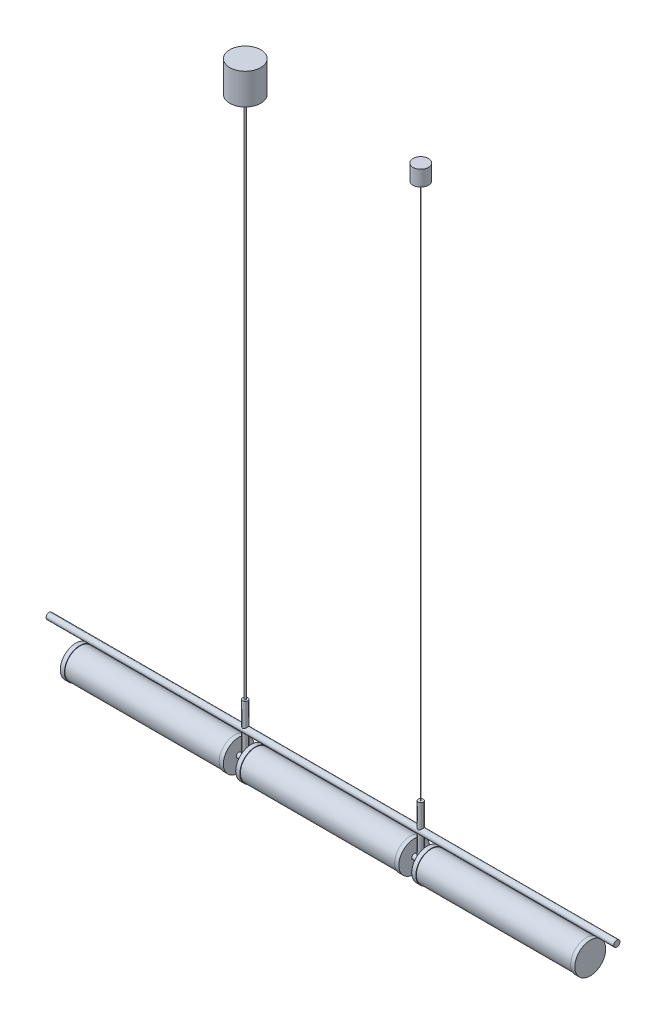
ISO-10303-21;
HEADER;
FILE_DESCRIPTION(('STEP AP214'),'2;1');
FILE_NAME('part.step','',(''),(''),'','','');
FILE_SCHEMA(('AUTOMOTIVE_DESIGN { 1 0 10303 214 1 1 1 1 }'));
ENDSEC;
DATA;
#1=APPLICATION_CONTEXT('core data for automotive mechanical design processes');
#2=APPLICATION_PROTOCOL_DEFINITION('international standard','automotive_design',2000,#1);
#3=PRODUCT_CONTEXT('',#1,'mechanical');
#4=PRODUCT('Part','Part','',(#3));
#5=PRODUCT_RELATED_PRODUCT_CATEGORY('part','',(#4));
#6=PRODUCT_DEFINITION_FORMATION('','',#4);
#7=PRODUCT_DEFINITION_CONTEXT('part definition',#1,'design');
#8=PRODUCT_DEFINITION('design','',#6,#7);
#9=PRODUCT_DEFINITION_SHAPE('','',#8);
#10=(LENGTH_UNIT() NAMED_UNIT(*) SI_UNIT(.MILLI.,.METRE.));
#11=(NAMED_UNIT(*) PLANE_ANGLE_UNIT() SI_UNIT($,.RADIAN.));
#12=(NAMED_UNIT(*) SI_UNIT($,.STERADIAN.) SOLID_ANGLE_UNIT());
#13=UNCERTAINTY_MEASURE_WITH_UNIT(LENGTH_MEASURE(1.E-05),#10,'distance_accuracy_value','');
#14=(GEOMETRIC_REPRESENTATION_CONTEXT(3) GLOBAL_UNCERTAINTY_ASSIGNED_CONTEXT((#13)) GLOBAL_UNIT_ASSIGNED_CONTEXT((#10,
#11,#12)) REPRESENTATION_CONTEXT('',''));
#15=CARTESIAN_POINT('',(0.,0.,0.));
#16=DIRECTION('',(0.,0.,1.));
#17=DIRECTION('',(1.,0.,0.));
#18=AXIS2_PLACEMENT_3D('',#15,#16,#17);
#19=CARTESIAN_POINT('',(-225.25274401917,-235.496317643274,1180.00000000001));
#20=DIRECTION('',(-1.,0.,0.));
#21=DIRECTION('',(0.,1.,0.));
#22=AXIS2_PLACEMENT_3D('',#19,#20,#21);
#23=CYLINDRICAL_SURFACE('',#22,30.);
#24=CARTESIAN_POINT('',(-225.25274401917,-235.496317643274,1180.00000000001));
#25=DIRECTION('',(1.,0.,0.));
#26=DIRECTION('',(0.,-1.,0.));
#27=AXIS2_PLACEMENT_3D('',#24,#25,#26);
#28=CIRCLE('',#27,30.);
#29=CARTESIAN_POINT('',(-225.252744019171,-265.496317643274,1180.00000000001));
#30=VERTEX_POINT('',#29);
#31=EDGE_CURVE('P0_E10',#30,#30,#28,.T.);
#32=ORIENTED_EDGE('',*,*,#31,.F.);
#33=EDGE_LOOP('',(#32));
#34=FACE_BOUND('',#33,.T.);
#35=CARTESIAN_POINT('',(-233.25274401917,-235.496317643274,1180.00000000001));
#36=DIRECTION('',(1.,0.,0.));
#37=DIRECTION('',(0.,-1.,0.));
#38=AXIS2_PLACEMENT_3D('',#35,#36,#37);
#39=CIRCLE('',#38,30.);
#40=CARTESIAN_POINT('',(-233.252744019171,-265.496317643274,1180.00000000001));
#41=VERTEX_POINT('',#40);
#42=EDGE_CURVE('P0_E17',#41,#41,#39,.T.);
#43=ORIENTED_EDGE('',*,*,#42,.T.);
#44=EDGE_LOOP('',(#43));
#45=FACE_BOUND('',#44,.T.);
#46=ADVANCED_FACE('P0_F14',(#34,#45),#23,.T.);
#47=CARTESIAN_POINT('',(-225.25274401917,-235.496317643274,1180.00000000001));
#48=DIRECTION('',(1.,0.,0.));
#49=DIRECTION('',(0.,-1.,0.));
#50=AXIS2_PLACEMENT_3D('',#47,#48,#49);
#51=PLANE('',#50);
#52=ORIENTED_EDGE('',*,*,#31,.T.);
#53=EDGE_LOOP('',(#52));
#54=FACE_BOUND('',#53,.T.);
#55=ADVANCED_FACE('P0_F29',(#54),#51,.T.);
#56=CARTESIAN_POINT('',(-233.25274401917,-235.496317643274,1180.00000000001));
#57=DIRECTION('',(1.,0.,0.));
#58=DIRECTION('',(0.,-1.,0.));
#59=AXIS2_PLACEMENT_3D('',#56,#57,#58);
#60=PLANE('',#59);
#61=ORIENTED_EDGE('',*,*,#42,.F.);
#62=EDGE_LOOP('',(#61));
#63=FACE_BOUND('',#62,.T.);
#64=ADVANCED_FACE('P0_F27',(#63),#60,.F.);
#65=CLOSED_SHELL('',(#46,#55,#64));
#66=MANIFOLD_SOLID_BREP('P0_B1',#65);
#67=CARTESIAN_POINT('',(-233.25274401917,-235.496317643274,1180.00000000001));
#68=DIRECTION('',(-1.,0.,0.));
#69=DIRECTION('',(0.,1.,0.));
#70=AXIS2_PLACEMENT_3D('',#67,#68,#69);
#71=CYLINDRICAL_SURFACE('',#70,29.);
#72=CARTESIAN_POINT('',(-233.25274401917,-235.496317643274,1180.00000000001));
#73=DIRECTION('',(1.,0.,0.));
#74=DIRECTION('',(0.,-1.,0.));
#75=AXIS2_PLACEMENT_3D('',#72,#73,#74);
#76=CIRCLE('',#75,29.);
#77=CARTESIAN_POINT('',(-233.252744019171,-264.496317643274,1180.00000000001));
#78=VERTEX_POINT('',#77);
#79=EDGE_CURVE('P1_E10',#78,#78,#76,.T.);
#80=ORIENTED_EDGE('',*,*,#79,.F.);
#81=EDGE_LOOP('',(#80));
#82=FACE_BOUND('',#81,.T.);
#83=CARTESIAN_POINT('',(-533.25274401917,-235.496317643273,1180.00000000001));
#84=DIRECTION('',(1.,0.,0.));
#85=DIRECTION('',(0.,-1.,0.));
#86=AXIS2_PLACEMENT_3D('',#83,#84,#85);
#87=CIRCLE('',#86,29.);
#88=CARTESIAN_POINT('',(-533.252744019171,-264.496317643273,1180.00000000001));
#89=VERTEX_POINT('',#88);
#90=EDGE_CURVE('P1_E17',#89,#89,#87,.T.);
#91=ORIENTED_EDGE('',*,*,#90,.T.);
#92=EDGE_LOOP('',(#91));
#93=FACE_BOUND('',#92,.T.);
#94=ADVANCED_FACE('P1_F14',(#82,#93),#71,.T.);
#95=CARTESIAN_POINT('',(-233.25274401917,-235.496317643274,1180.00000000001));
#96=DIRECTION('',(1.,0.,0.));
#97=DIRECTION('',(0.,-1.,0.));
#98=AXIS2_PLACEMENT_3D('',#95,#96,#97);
#99=PLANE('',#98);
#100=ORIENTED_EDGE('',*,*,#79,.T.);
#101=EDGE_LOOP('',(#100));
#102=FACE_BOUND('',#101,.T.);
#103=ADVANCED_FACE('P1_F29',(#102),#99,.T.);
#104=CARTESIAN_POINT('',(-533.25274401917,-235.496317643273,1180.00000000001));
#105=DIRECTION('',(1.,0.,0.));
#106=DIRECTION('',(0.,-1.,0.));
#107=AXIS2_PLACEMENT_3D('',#104,#105,#106);
#108=PLANE('',#107);
#109=ORIENTED_EDGE('',*,*,#90,.F.);
#110=EDGE_LOOP('',(#109));
#111=FACE_BOUND('',#110,.T.);
#112=ADVANCED_FACE('P1_F27',(#111),#108,.F.);
#113=CLOSED_SHELL('',(#94,#103,#112));
#114=MANIFOLD_SOLID_BREP('P1_B1',#113);
#115=CARTESIAN_POINT('',(-533.25274401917,-235.496317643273,1180.00000000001));
#116=DIRECTION('',(-1.,0.,0.));
#117=DIRECTION('',(0.,1.,0.));
#118=AXIS2_PLACEMENT_3D('',#115,#116,#117);
#119=CYLINDRICAL_SURFACE('',#118,30.);
#120=CARTESIAN_POINT('',(-533.25274401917,-235.496317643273,1180.00000000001));
#121=DIRECTION('',(1.,0.,0.));
#122=DIRECTION('',(0.,-1.,0.));
#123=AXIS2_PLACEMENT_3D('',#120,#121,#122);
#124=CIRCLE('',#123,30.);
#125=CARTESIAN_POINT('',(-533.252744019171,-265.496317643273,1180.00000000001));
#126=VERTEX_POINT('',#125);
#127=EDGE_CURVE('P2_E10',#126,#126,#124,.T.);
#128=ORIENTED_EDGE('',*,*,#127,.F.);
#129=EDGE_LOOP('',(#128));
#130=FACE_BOUND('',#129,.T.);
#131=CARTESIAN_POINT('',(-541.25274401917,-235.496317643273,1180.00000000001));
#132=DIRECTION('',(1.,0.,0.));
#133=DIRECTION('',(0.,-1.,0.));
#134=AXIS2_PLACEMENT_3D('',#131,#132,#133);
#135=CIRCLE('',#134,30.);
#136=CARTESIAN_POINT('',(-541.252744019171,-265.496317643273,1180.00000000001));
#137=VERTEX_POINT('',#136);
#138=EDGE_CURVE('P2_E17',#137,#137,#135,.T.);
#139=ORIENTED_EDGE('',*,*,#138,.T.);
#140=EDGE_LOOP('',(#139));
#141=FACE_BOUND('',#140,.T.);
#142=ADVANCED_FACE('P2_F14',(#130,#141),#119,.T.);
#143=CARTESIAN_POINT('',(-533.25274401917,-235.496317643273,1180.00000000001));
#144=DIRECTION('',(1.,0.,0.));
#145=DIRECTION('',(0.,-1.,0.));
#146=AXIS2_PLACEMENT_3D('',#143,#144,#145);
#147=PLANE('',#146);
#148=ORIENTED_EDGE('',*,*,#127,.T.);
#149=EDGE_LOOP('',(#148));
#150=FACE_BOUND('',#149,.T.);
#151=ADVANCED_FACE('P2_F29',(#150),#147,.T.);
#152=CARTESIAN_POINT('',(-541.25274401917,-235.496317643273,1180.00000000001));
#153=DIRECTION('',(1.,0.,0.));
#154=DIRECTION('',(0.,-1.,0.));
#155=AXIS2_PLACEMENT_3D('',#152,#153,#154);
#156=PLANE('',#155);
#157=ORIENTED_EDGE('',*,*,#138,.F.);
#158=EDGE_LOOP('',(#157));
#159=FACE_BOUND('',#158,.T.);
#160=ADVANCED_FACE('P2_F27',(#159),#156,.F.);
#161=CLOSED_SHELL('',(#142,#151,#160));
#162=MANIFOLD_SOLID_BREP('P2_B1',#161);
#163=CARTESIAN_POINT('',(114.747255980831,-235.496317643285,1180.));
#164=DIRECTION('',(-1.,0.,0.));
#165=DIRECTION('',(0.,0.996490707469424,0.0837034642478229));
#166=AXIS2_PLACEMENT_3D('',#163,#164,#165);
#167=CYLINDRICAL_SURFACE('',#166,30.);
#168=CARTESIAN_POINT('',(114.747255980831,-235.496317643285,1180.));
#169=DIRECTION('',(1.,0.,0.));
#170=DIRECTION('',(0.,-0.996490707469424,-0.0837034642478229));
#171=AXIS2_PLACEMENT_3D('',#168,#169,#170);
#172=CIRCLE('',#171,30.);
#173=CARTESIAN_POINT('',(114.747255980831,-265.391038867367,1177.48889607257));
#174=VERTEX_POINT('',#173);
#175=EDGE_CURVE('P3_E10',#174,#174,#172,.T.);
#176=ORIENTED_EDGE('',*,*,#175,.F.);
#177=EDGE_LOOP('',(#176));
#178=FACE_BOUND('',#177,.T.);
#179=CARTESIAN_POINT('',(106.747255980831,-235.496317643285,1180.));
#180=DIRECTION('',(1.,0.,0.));
#181=DIRECTION('',(0.,-0.996490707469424,-0.0837034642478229));
#182=AXIS2_PLACEMENT_3D('',#179,#180,#181);
#183=CIRCLE('',#182,30.);
#184=CARTESIAN_POINT('',(106.747255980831,-265.391038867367,1177.48889607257));
#185=VERTEX_POINT('',#184);
#186=EDGE_CURVE('P3_E17',#185,#185,#183,.T.);
#187=ORIENTED_EDGE('',*,*,#186,.T.);
#188=EDGE_LOOP('',(#187));
#189=FACE_BOUND('',#188,.T.);
#190=ADVANCED_FACE('P3_F14',(#178,#189),#167,.T.);
#191=CARTESIAN_POINT('',(114.747255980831,-235.496317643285,1180.));
#192=DIRECTION('',(1.,0.,0.));
#193=DIRECTION('',(0.,-0.996490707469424,-0.0837034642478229));
#194=AXIS2_PLACEMENT_3D('',#191,#192,#193);
#195=PLANE('',#194);
#196=ORIENTED_EDGE('',*,*,#175,.T.);
#197=EDGE_LOOP('',(#196));
#198=FACE_BOUND('',#197,.T.);
#199=ADVANCED_FACE('P3_F29',(#198),#195,.T.);
#200=CARTESIAN_POINT('',(106.747255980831,-235.496317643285,1180.));
#201=DIRECTION('',(1.,0.,0.));
#202=DIRECTION('',(0.,-0.996490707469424,-0.0837034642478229));
#203=AXIS2_PLACEMENT_3D('',#200,#201,#202);
#204=PLANE('',#203);
#205=ORIENTED_EDGE('',*,*,#186,.F.);
#206=EDGE_LOOP('',(#205));
#207=FACE_BOUND('',#206,.T.);
#208=ADVANCED_FACE('P3_F27',(#207),#204,.F.);
#209=CLOSED_SHELL('',(#190,#199,#208));
#210=MANIFOLD_SOLID_BREP('P3_B1',#209);
#211=CARTESIAN_POINT('',(106.747255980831,-235.496317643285,1180.));
#212=DIRECTION('',(-1.,0.,0.));
#213=DIRECTION('',(0.,0.996490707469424,0.0837034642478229));
#214=AXIS2_PLACEMENT_3D('',#211,#212,#213);
#215=CYLINDRICAL_SURFACE('',#214,29.);
#216=CARTESIAN_POINT('',(106.747255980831,-235.496317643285,1180.));
#217=DIRECTION('',(1.,0.,0.));
#218=DIRECTION('',(0.,-0.996490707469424,-0.0837034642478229));
#219=AXIS2_PLACEMENT_3D('',#216,#217,#218);
#220=CIRCLE('',#219,29.);
#221=CARTESIAN_POINT('',(106.747255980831,-264.394548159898,1177.57259953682));
#222=VERTEX_POINT('',#221);
#223=EDGE_CURVE('P4_E10',#222,#222,#220,.T.);
#224=ORIENTED_EDGE('',*,*,#223,.F.);
#225=EDGE_LOOP('',(#224));
#226=FACE_BOUND('',#225,.T.);
#227=CARTESIAN_POINT('',(-193.252744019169,-235.496317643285,1180.00000000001));
#228=DIRECTION('',(1.,0.,0.));
#229=DIRECTION('',(0.,-0.996490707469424,-0.0837034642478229));
#230=AXIS2_PLACEMENT_3D('',#227,#228,#229);
#231=CIRCLE('',#230,29.);
#232=CARTESIAN_POINT('',(-193.252744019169,-264.394548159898,1177.57259953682));
#233=VERTEX_POINT('',#232);
#234=EDGE_CURVE('P4_E17',#233,#233,#231,.T.);
#235=ORIENTED_EDGE('',*,*,#234,.T.);
#236=EDGE_LOOP('',(#235));
#237=FACE_BOUND('',#236,.T.);
#238=ADVANCED_FACE('P4_F14',(#226,#237),#215,.T.);
#239=CARTESIAN_POINT('',(106.747255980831,-235.496317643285,1180.));
#240=DIRECTION('',(1.,0.,0.));
#241=DIRECTION('',(0.,-0.996490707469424,-0.0837034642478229));
#242=AXIS2_PLACEMENT_3D('',#239,#240,#241);
#243=PLANE('',#242);
#244=ORIENTED_EDGE('',*,*,#223,.T.);
#245=EDGE_LOOP('',(#244));
#246=FACE_BOUND('',#245,.T.);
#247=ADVANCED_FACE('P4_F29',(#246),#243,.T.);
#248=CARTESIAN_POINT('',(-193.252744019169,-235.496317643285,1180.00000000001));
#249=DIRECTION('',(1.,0.,0.));
#250=DIRECTION('',(0.,-0.996490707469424,-0.0837034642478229));
#251=AXIS2_PLACEMENT_3D('',#248,#249,#250);
#252=PLANE('',#251);
#253=ORIENTED_EDGE('',*,*,#234,.F.);
#254=EDGE_LOOP('',(#253));
#255=FACE_BOUND('',#254,.T.);
#256=ADVANCED_FACE('P4_F27',(#255),#252,.F.);
#257=CLOSED_SHELL('',(#238,#247,#256));
#258=MANIFOLD_SOLID_BREP('P4_B1',#257);
#259=CARTESIAN_POINT('',(-193.252744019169,-235.496317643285,1180.00000000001));
#260=DIRECTION('',(-1.,0.,0.));
#261=DIRECTION('',(0.,0.996490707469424,0.0837034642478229));
#262=AXIS2_PLACEMENT_3D('',#259,#260,#261);
#263=CYLINDRICAL_SURFACE('',#262,30.);
#264=CARTESIAN_POINT('',(-193.252744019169,-235.496317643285,1180.00000000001));
#265=DIRECTION('',(1.,0.,0.));
#266=DIRECTION('',(0.,-0.996490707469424,-0.0837034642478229));
#267=AXIS2_PLACEMENT_3D('',#264,#265,#266);
#268=CIRCLE('',#267,30.);
#269=CARTESIAN_POINT('',(-193.252744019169,-265.391038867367,1177.48889607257));
#270=VERTEX_POINT('',#269);
#271=EDGE_CURVE('P5_E10',#270,#270,#268,.T.);
#272=ORIENTED_EDGE('',*,*,#271,.F.);
#273=EDGE_LOOP('',(#272));
#274=FACE_BOUND('',#273,.T.);
#275=CARTESIAN_POINT('',(-201.252744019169,-235.496317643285,1180.00000000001));
#276=DIRECTION('',(1.,0.,0.));
#277=DIRECTION('',(0.,-0.996490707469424,-0.0837034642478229));
#278=AXIS2_PLACEMENT_3D('',#275,#276,#277);
#279=CIRCLE('',#278,30.);
#280=CARTESIAN_POINT('',(-201.252744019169,-265.391038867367,1177.48889607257));
#281=VERTEX_POINT('',#280);
#282=EDGE_CURVE('P5_E17',#281,#281,#279,.T.);
#283=ORIENTED_EDGE('',*,*,#282,.T.);
#284=EDGE_LOOP('',(#283));
#285=FACE_BOUND('',#284,.T.);
#286=ADVANCED_FACE('P5_F14',(#274,#285),#263,.T.);
#287=CARTESIAN_POINT('',(-193.252744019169,-235.496317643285,1180.00000000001));
#288=DIRECTION('',(1.,0.,0.));
#289=DIRECTION('',(0.,-0.996490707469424,-0.0837034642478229));
#290=AXIS2_PLACEMENT_3D('',#287,#288,#289);
#291=PLANE('',#290);
#292=ORIENTED_EDGE('',*,*,#271,.T.);
#293=EDGE_LOOP('',(#292));
#294=FACE_BOUND('',#293,.T.);
#295=ADVANCED_FACE('P5_F29',(#294),#291,.T.);
#296=CARTESIAN_POINT('',(-201.252744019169,-235.496317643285,1180.00000000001));
#297=DIRECTION('',(1.,0.,0.));
#298=DIRECTION('',(0.,-0.996490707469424,-0.0837034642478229));
#299=AXIS2_PLACEMENT_3D('',#296,#297,#298);
#300=PLANE('',#299);
#301=ORIENTED_EDGE('',*,*,#282,.F.);
#302=EDGE_LOOP('',(#301));
#303=FACE_BOUND('',#302,.T.);
#304=ADVANCED_FACE('P5_F27',(#303),#300,.F.);
#305=CLOSED_SHELL('',(#286,#295,#304));
#306=MANIFOLD_SOLID_BREP('P5_B1',#305);
#307=CARTESIAN_POINT('',(455.74725598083,-235.496317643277,1180.));
#308=DIRECTION('',(-1.,0.,0.));
#309=DIRECTION('',(0.,1.,0.));
#310=AXIS2_PLACEMENT_3D('',#307,#308,#309);
#311=CYLINDRICAL_SURFACE('',#310,30.);
#312=CARTESIAN_POINT('',(455.74725598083,-235.496317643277,1180.));
#313=DIRECTION('',(1.,0.,0.));
#314=DIRECTION('',(0.,-1.,0.));
#315=AXIS2_PLACEMENT_3D('',#312,#313,#314);
#316=CIRCLE('',#315,30.);
#317=CARTESIAN_POINT('',(455.74725598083,-265.496317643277,1180.));
#318=VERTEX_POINT('',#317);
#319=EDGE_CURVE('P6_E10',#318,#318,#316,.T.);
#320=ORIENTED_EDGE('',*,*,#319,.F.);
#321=EDGE_LOOP('',(#320));
#322=FACE_BOUND('',#321,.T.);
#323=CARTESIAN_POINT('',(447.74725598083,-235.496317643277,1180.));
#324=DIRECTION('',(1.,0.,0.));
#325=DIRECTION('',(0.,-1.,0.));
#326=AXIS2_PLACEMENT_3D('',#323,#324,#325);
#327=CIRCLE('',#326,30.);
#328=CARTESIAN_POINT('',(447.74725598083,-265.496317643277,1180.));
#329=VERTEX_POINT('',#328);
#330=EDGE_CURVE('P6_E17',#329,#329,#327,.T.);
#331=ORIENTED_EDGE('',*,*,#330,.T.);
#332=EDGE_LOOP('',(#331));
#333=FACE_BOUND('',#332,.T.);
#334=ADVANCED_FACE('P6_F14',(#322,#333),#311,.T.);
#335=CARTESIAN_POINT('',(455.74725598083,-235.496317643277,1180.));
#336=DIRECTION('',(1.,0.,0.));
#337=DIRECTION('',(0.,-1.,0.));
#338=AXIS2_PLACEMENT_3D('',#335,#336,#337);
#339=PLANE('',#338);
#340=ORIENTED_EDGE('',*,*,#319,.T.);
#341=EDGE_LOOP('',(#340));
#342=FACE_BOUND('',#341,.T.);
#343=ADVANCED_FACE('P6_F29',(#342),#339,.T.);
#344=CARTESIAN_POINT('',(447.74725598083,-235.496317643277,1180.));
#345=DIRECTION('',(1.,0.,0.));
#346=DIRECTION('',(0.,-1.,0.));
#347=AXIS2_PLACEMENT_3D('',#344,#345,#346);
#348=PLANE('',#347);
#349=ORIENTED_EDGE('',*,*,#330,.F.);
#350=EDGE_LOOP('',(#349));
#351=FACE_BOUND('',#350,.T.);
#352=ADVANCED_FACE('P6_F27',(#351),#348,.F.);
#353=CLOSED_SHELL('',(#334,#343,#352));
#354=MANIFOLD_SOLID_BREP('P6_B1',#353);
#355=CARTESIAN_POINT('',(447.74725598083,-235.496317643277,1180.));
#356=DIRECTION('',(-1.,0.,0.));
#357=DIRECTION('',(0.,1.,0.));
#358=AXIS2_PLACEMENT_3D('',#355,#356,#357);
#359=CYLINDRICAL_SURFACE('',#358,29.);
#360=CARTESIAN_POINT('',(447.74725598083,-235.496317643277,1180.));
#361=DIRECTION('',(1.,0.,0.));
#362=DIRECTION('',(0.,-1.,0.));
#363=AXIS2_PLACEMENT_3D('',#360,#361,#362);
#364=CIRCLE('',#363,29.);
#365=CARTESIAN_POINT('',(447.74725598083,-264.496317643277,1180.));
#366=VERTEX_POINT('',#365);
#367=EDGE_CURVE('P7_E10',#366,#366,#364,.T.);
#368=ORIENTED_EDGE('',*,*,#367,.F.);
#369=EDGE_LOOP('',(#368));
#370=FACE_BOUND('',#369,.T.);
#371=CARTESIAN_POINT('',(147.74725598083,-235.496317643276,1180.00000000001));
#372=DIRECTION('',(1.,0.,0.));
#373=DIRECTION('',(0.,-1.,0.));
#374=AXIS2_PLACEMENT_3D('',#371,#372,#373);
#375=CIRCLE('',#374,29.);
#376=CARTESIAN_POINT('',(147.74725598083,-264.496317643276,1180.00000000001));
#377=VERTEX_POINT('',#376);
#378=EDGE_CURVE('P7_E17',#377,#377,#375,.T.);
#379=ORIENTED_EDGE('',*,*,#378,.T.);
#380=EDGE_LOOP('',(#379));
#381=FACE_BOUND('',#380,.T.);
#382=ADVANCED_FACE('P7_F14',(#370,#381),#359,.T.);
#383=CARTESIAN_POINT('',(447.74725598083,-235.496317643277,1180.));
#384=DIRECTION('',(1.,0.,0.));
#385=DIRECTION('',(0.,-1.,0.));
#386=AXIS2_PLACEMENT_3D('',#383,#384,#385);
#387=PLANE('',#386);
#388=ORIENTED_EDGE('',*,*,#367,.T.);
#389=EDGE_LOOP('',(#388));
#390=FACE_BOUND('',#389,.T.);
#391=ADVANCED_FACE('P7_F29',(#390),#387,.T.);
#392=CARTESIAN_POINT('',(147.74725598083,-235.496317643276,1180.00000000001));
#393=DIRECTION('',(1.,0.,0.));
#394=DIRECTION('',(0.,-1.,0.));
#395=AXIS2_PLACEMENT_3D('',#392,#393,#394);
#396=PLANE('',#395);
#397=ORIENTED_EDGE('',*,*,#378,.F.);
#398=EDGE_LOOP('',(#397));
#399=FACE_BOUND('',#398,.T.);
#400=ADVANCED_FACE('P7_F27',(#399),#396,.F.);
#401=CLOSED_SHELL('',(#382,#391,#400));
#402=MANIFOLD_SOLID_BREP('P7_B1',#401);
#403=CARTESIAN_POINT('',(147.74725598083,-235.496317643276,1180.00000000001));
#404=DIRECTION('',(-1.,0.,0.));
#405=DIRECTION('',(0.,1.,0.));
#406=AXIS2_PLACEMENT_3D('',#403,#404,#405);
#407=CYLINDRICAL_SURFACE('',#406,30.);
#408=CARTESIAN_POINT('',(147.74725598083,-235.496317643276,1180.00000000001));
#409=DIRECTION('',(1.,0.,0.));
#410=DIRECTION('',(0.,-1.,0.));
#411=AXIS2_PLACEMENT_3D('',#408,#409,#410);
#412=CIRCLE('',#411,30.);
#413=CARTESIAN_POINT('',(147.74725598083,-265.496317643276,1180.00000000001));
#414=VERTEX_POINT('',#413);
#415=EDGE_CURVE('P8_E10',#414,#414,#412,.T.);
#416=ORIENTED_EDGE('',*,*,#415,.F.);
#417=EDGE_LOOP('',(#416));
#418=FACE_BOUND('',#417,.T.);
#419=CARTESIAN_POINT('',(139.74725598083,-235.496317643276,1180.00000000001));
#420=DIRECTION('',(1.,0.,0.));
#421=DIRECTION('',(0.,-1.,0.));
#422=AXIS2_PLACEMENT_3D('',#419,#420,#421);
#423=CIRCLE('',#422,30.);
#424=CARTESIAN_POINT('',(139.74725598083,-265.496317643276,1180.00000000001));
#425=VERTEX_POINT('',#424);
#426=EDGE_CURVE('P8_E17',#425,#425,#423,.T.);
#427=ORIENTED_EDGE('',*,*,#426,.T.);
#428=EDGE_LOOP('',(#427));
#429=FACE_BOUND('',#428,.T.);
#430=ADVANCED_FACE('P8_F14',(#418,#429),#407,.T.);
#431=CARTESIAN_POINT('',(147.74725598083,-235.496317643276,1180.00000000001));
#432=DIRECTION('',(1.,0.,0.));
#433=DIRECTION('',(0.,-1.,0.));
#434=AXIS2_PLACEMENT_3D('',#431,#432,#433);
#435=PLANE('',#434);
#436=ORIENTED_EDGE('',*,*,#415,.T.);
#437=EDGE_LOOP('',(#436));
#438=FACE_BOUND('',#437,.T.);
#439=ADVANCED_FACE('P8_F29',(#438),#435,.T.);
#440=CARTESIAN_POINT('',(139.74725598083,-235.496317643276,1180.00000000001));
#441=DIRECTION('',(1.,0.,0.));
#442=DIRECTION('',(0.,-1.,0.));
#443=AXIS2_PLACEMENT_3D('',#440,#441,#442);
#444=PLANE('',#443);
#445=ORIENTED_EDGE('',*,*,#426,.F.);
#446=EDGE_LOOP('',(#445));
#447=FACE_BOUND('',#446,.T.);
#448=ADVANCED_FACE('P8_F27',(#447),#444,.F.);
#449=CLOSED_SHELL('',(#430,#439,#448));
#450=MANIFOLD_SOLID_BREP('P8_B1',#449);
#451=CARTESIAN_POINT('',(-212.75274401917,-235.49631764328,1180.00000000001));
#452=DIRECTION('',(0.,1.,0.));
#453=DIRECTION('',(1.,0.,0.));
#454=AXIS2_PLACEMENT_3D('',#451,#452,#453);
#455=CYLINDRICAL_SURFACE('',#454,5.00000000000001);
#456=CARTESIAN_POINT('',(-207.75274401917,-191.49631764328,1180.00000000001));
#457=CARTESIAN_POINT('',(-207.752737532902,-191.496324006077,1180.1188034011));
#458=CARTESIAN_POINT('',(-207.756981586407,-191.492785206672,1180.23755818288));
#459=CARTESIAN_POINT('',(-207.773860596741,-191.4787298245,1180.47408783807));
#460=CARTESIAN_POINT('',(-207.786496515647,-191.468212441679,1180.59186259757));
#461=CARTESIAN_POINT('',(-207.819943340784,-191.440426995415,1180.8254747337));
#462=CARTESIAN_POINT('',(-207.840757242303,-191.423156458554,1180.94131138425));
#463=CARTESIAN_POINT('',(-207.890192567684,-191.382251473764,1181.17018155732));
#464=CARTESIAN_POINT('',(-207.91881746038,-191.358614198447,1181.28321381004));
#465=CARTESIAN_POINT('',(-208.015340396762,-191.279192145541,1181.61550772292));
#466=CARTESIAN_POINT('',(-208.094136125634,-191.214687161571,1181.82964493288));
#467=CARTESIAN_POINT('',(-208.2767961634,-191.066885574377,1182.23973970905));
#468=CARTESIAN_POINT('',(-208.380668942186,-190.983582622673,1182.4356911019));
#469=CARTESIAN_POINT('',(-208.573426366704,-190.831520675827,1182.74874935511));
#470=CARTESIAN_POINT('',(-208.656690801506,-190.766472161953,1182.87121824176));
#471=CARTESIAN_POINT('',(-208.832169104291,-190.631273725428,1183.10654667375));
#472=CARTESIAN_POINT('',(-208.92438285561,-190.561123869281,1183.21940634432));
#473=CARTESIAN_POINT('',(-209.117210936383,-190.416986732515,1183.43568816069));
#474=CARTESIAN_POINT('',(-209.217847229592,-190.342989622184,1183.53908406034));
#475=CARTESIAN_POINT('',(-209.426736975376,-190.192810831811,1183.73607907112));
#476=CARTESIAN_POINT('',(-209.534989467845,-190.116629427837,1183.82967941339));
#477=CARTESIAN_POINT('',(-209.760875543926,-189.962227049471,1184.00872533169));
#478=CARTESIAN_POINT('',(-209.878645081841,-189.883994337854,1184.09398918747));
#479=CARTESIAN_POINT('',(-210.121765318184,-189.728726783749,1184.25431125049));
#480=CARTESIAN_POINT('',(-210.24711853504,-189.651692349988,1184.32936604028));
#481=CARTESIAN_POINT('',(-210.505275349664,-189.501329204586,1184.46882104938));
#482=CARTESIAN_POINT('',(-210.638060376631,-189.427992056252,1184.53324636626));
#483=CARTESIAN_POINT('',(-210.911639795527,-189.287871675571,1184.6510740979));
#484=CARTESIAN_POINT('',(-211.052427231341,-189.221082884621,1184.70448590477));
#485=CARTESIAN_POINT('',(-211.356067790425,-189.092153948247,1184.80387055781));
#486=CARTESIAN_POINT('',(-211.519752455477,-189.031035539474,1184.84867766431));
#487=CARTESIAN_POINT('',(-211.856563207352,-188.928189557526,1184.92202476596));
#488=CARTESIAN_POINT('',(-212.029665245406,-188.886414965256,1184.95060424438));
#489=CARTESIAN_POINT('',(-212.2950821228,-188.843201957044,1184.9798244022));
#490=CARTESIAN_POINT('',(-212.385125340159,-188.832031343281,1184.98729261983));
#491=CARTESIAN_POINT('',(-212.566108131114,-188.816969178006,1184.9973356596));
#492=CARTESIAN_POINT('',(-212.657047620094,-188.813076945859,1184.99991093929));
#493=CARTESIAN_POINT('',(-212.838939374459,-188.812814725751,1185.00008454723));
#494=CARTESIAN_POINT('',(-212.92989163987,-188.816444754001,1184.99768286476));
#495=CARTESIAN_POINT('',(-213.110943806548,-188.831008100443,1184.98797701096));
#496=CARTESIAN_POINT('',(-213.201043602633,-188.84194230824,1184.98067224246));
#497=CARTESIAN_POINT('',(-213.387034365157,-188.871700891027,1184.96055777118));
#498=CARTESIAN_POINT('',(-213.482788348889,-188.891102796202,1184.9473429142));
#499=CARTESIAN_POINT('',(-213.671816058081,-188.936705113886,1184.91574053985));
#500=CARTESIAN_POINT('',(-213.765087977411,-188.962910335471,1184.8973493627));
#501=CARTESIAN_POINT('',(-214.041011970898,-189.050061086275,1184.83487145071));
#502=CARTESIAN_POINT('',(-214.219389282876,-189.11947190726,1184.78352415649));
#503=CARTESIAN_POINT('',(-214.528424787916,-189.256366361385,1184.67632227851));
#504=CARTESIAN_POINT('',(-214.661366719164,-189.321325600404,1184.62355194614));
#505=CARTESIAN_POINT('',(-214.920047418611,-189.456755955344,1184.50808681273));
#506=CARTESIAN_POINT('',(-215.045781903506,-189.527230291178,1184.44538619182));
#507=CARTESIAN_POINT('',(-215.290406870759,-189.671236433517,1184.31043075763));
#508=CARTESIAN_POINT('',(-215.40928785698,-189.744772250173,1184.23816312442));
#509=CARTESIAN_POINT('',(-215.640179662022,-189.892844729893,1184.08435401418));
#510=CARTESIAN_POINT('',(-215.752191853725,-189.9673811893,1184.00281439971));
#511=CARTESIAN_POINT('',(-215.975005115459,-190.119738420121,1183.82600354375));
#512=CARTESIAN_POINT('',(-216.085436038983,-190.197526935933,1183.73023700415));
#513=CARTESIAN_POINT('',(-216.298343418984,-190.350781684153,1183.52848927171));
#514=CARTESIAN_POINT('',(-216.40081869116,-190.426247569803,1183.42250656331));
#515=CARTESIAN_POINT('',(-216.596996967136,-190.573134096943,1183.2005612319));
#516=CARTESIAN_POINT('',(-216.690717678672,-190.644562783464,1183.08461970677));
#517=CARTESIAN_POINT('',(-216.868738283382,-190.781978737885,1182.84274064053));
#518=CARTESIAN_POINT('',(-216.953037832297,-190.847965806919,1182.71680273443));
#519=CARTESIAN_POINT('',(-217.151529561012,-191.004850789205,1182.38827463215));
#520=CARTESIAN_POINT('',(-217.259063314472,-191.091307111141,1182.17932731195));
#521=CARTESIAN_POINT('',(-217.398882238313,-191.204721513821,1181.85137170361));
#522=CARTESIAN_POINT('',(-217.441917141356,-191.239822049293,1181.73959798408));
#523=CARTESIAN_POINT('',(-217.520261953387,-191.303960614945,1181.51170856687));
#524=CARTESIAN_POINT('',(-217.555575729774,-191.333001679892,1181.3955950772));
#525=CARTESIAN_POINT('',(-217.618178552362,-191.38462282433,1181.15874024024));
#526=CARTESIAN_POINT('',(-217.645398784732,-191.407147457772,1181.03796855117));
#527=CARTESIAN_POINT('',(-217.690911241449,-191.44487486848,1180.79368071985));
#528=CARTESIAN_POINT('',(-217.709207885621,-191.460081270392,1180.67016596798));
#529=CARTESIAN_POINT('',(-217.736520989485,-191.482800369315,1180.42144390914));
#530=CARTESIAN_POINT('',(-217.745540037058,-191.490315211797,1180.29623708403));
#531=CARTESIAN_POINT('',(-217.754114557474,-191.497459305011,1180.04528136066));
#532=CARTESIAN_POINT('',(-217.75367106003,-191.497089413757,1179.91953252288));
#533=CARTESIAN_POINT('',(-217.743957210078,-191.488996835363,1179.68378230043));
#534=CARTESIAN_POINT('',(-217.735753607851,-191.482162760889,1179.57370385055));
#535=CARTESIAN_POINT('',(-217.712165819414,-191.46254104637,1179.35482142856));
#536=CARTESIAN_POINT('',(-217.696779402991,-191.449751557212,1179.24601786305));
#537=CARTESIAN_POINT('',(-217.659067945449,-191.418471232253,1179.03049106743));
#538=CARTESIAN_POINT('',(-217.636745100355,-191.399982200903,1178.92376719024));
#539=CARTESIAN_POINT('',(-217.585485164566,-191.357646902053,1178.71298916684));
#540=CARTESIAN_POINT('',(-217.55654555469,-191.333798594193,1178.60893605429));
#541=CARTESIAN_POINT('',(-217.459523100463,-191.254127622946,1178.29899642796));
#542=CARTESIAN_POINT('',(-217.381718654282,-191.190583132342,1178.0980268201));
#543=CARTESIAN_POINT('',(-217.203936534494,-191.047025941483,1177.71263377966));
#544=CARTESIAN_POINT('',(-217.103950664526,-190.967007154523,1177.52821649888));
#545=CARTESIAN_POINT('',(-216.915157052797,-190.818281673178,1177.22568977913));
#546=CARTESIAN_POINT('',(-216.830822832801,-190.75250518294,1177.10328108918));
#547=CARTESIAN_POINT('',(-216.653180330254,-190.615904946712,1176.86817875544));
#548=CARTESIAN_POINT('',(-216.559871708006,-190.545081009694,1176.75548547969));
#549=CARTESIAN_POINT('',(-216.364790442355,-190.399646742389,1176.53960171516));
#550=CARTESIAN_POINT('',(-216.262993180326,-190.325025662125,1176.43644083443));
#551=CARTESIAN_POINT('',(-216.051737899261,-190.173701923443,1176.24002114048));
#552=CARTESIAN_POINT('',(-215.9422809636,-190.096999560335,1176.1467609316));
#553=CARTESIAN_POINT('',(-215.713957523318,-189.941724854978,1175.96855291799));
#554=CARTESIAN_POINT('',(-215.594957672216,-189.863143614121,1175.88378375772));
#555=CARTESIAN_POINT('',(-215.34929218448,-189.707377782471,1175.72456146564));
#556=CARTESIAN_POINT('',(-215.22262381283,-189.630193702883,1175.65011204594));
#557=CARTESIAN_POINT('',(-214.96177055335,-189.479840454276,1175.51202420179));
#558=CARTESIAN_POINT('',(-214.827606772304,-189.406661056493,1175.44835727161));
#559=CARTESIAN_POINT('',(-214.551160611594,-189.26726922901,1175.33222261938));
#560=CARTESIAN_POINT('',(-214.408885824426,-189.201050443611,1175.27974463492));
#561=CARTESIAN_POINT('',(-214.104213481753,-189.074826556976,1175.18325247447));
#562=CARTESIAN_POINT('',(-213.941113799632,-189.015723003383,1175.14023183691));
#563=CARTESIAN_POINT('',(-213.605801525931,-188.917187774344,1175.07035675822));
#564=CARTESIAN_POINT('',(-213.43361287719,-188.877707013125,1175.04346194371));
#565=CARTESIAN_POINT('',(-213.170011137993,-188.837929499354,1175.01664115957));
#566=CARTESIAN_POINT('',(-213.080683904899,-188.827910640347,1175.00995602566));
#567=CARTESIAN_POINT('',(-212.901266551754,-188.815064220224,1175.00140124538));
#568=CARTESIAN_POINT('',(-212.811176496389,-188.81223605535,1174.99953119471));
#569=CARTESIAN_POINT('',(-212.63109979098,-188.813949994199,1175.00066859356));
#570=CARTESIAN_POINT('',(-212.541113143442,-188.818492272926,1175.0036761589));
#571=CARTESIAN_POINT('',(-212.362038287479,-188.834684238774,1175.01448079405));
#572=CARTESIAN_POINT('',(-212.272950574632,-188.846337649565,1175.02228037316));
#573=CARTESIAN_POINT('',(-212.087074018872,-188.877716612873,1175.04353613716));
#574=CARTESIAN_POINT('',(-211.990466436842,-188.898165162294,1175.05750306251));
#575=CARTESIAN_POINT('',(-211.799846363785,-188.945880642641,1175.09068624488));
#576=CARTESIAN_POINT('',(-211.705835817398,-188.973152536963,1175.10990632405));
#577=CARTESIAN_POINT('',(-211.427838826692,-189.063468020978,1175.17497106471));
#578=CARTESIAN_POINT('',(-211.248269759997,-189.134937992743,1175.22817398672));
#579=CARTESIAN_POINT('',(-210.937138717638,-189.275374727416,1175.3389866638));
#580=CARTESIAN_POINT('',(-210.803258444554,-189.341875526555,1175.39348105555));
#581=CARTESIAN_POINT('',(-210.542849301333,-189.480219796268,1175.5125893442));
#582=CARTESIAN_POINT('',(-210.416324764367,-189.552066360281,1175.57720912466));
#583=CARTESIAN_POINT('',(-210.170268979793,-189.698626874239,1175.71621410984));
#584=CARTESIAN_POINT('',(-210.050747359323,-189.773344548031,1175.79061232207));
#585=CARTESIAN_POINT('',(-209.818744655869,-189.923568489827,1175.94890652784));
#586=CARTESIAN_POINT('',(-209.706262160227,-189.999074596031,1176.03280060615));
#587=CARTESIAN_POINT('',(-209.483041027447,-190.152937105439,1176.21440271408));
#588=CARTESIAN_POINT('',(-209.372659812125,-190.231251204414,1176.31258702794));
#589=CARTESIAN_POINT('',(-209.160081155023,-190.385271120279,1176.51937291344));
#590=CARTESIAN_POINT('',(-209.057885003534,-190.460976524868,1176.6279761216));
#591=CARTESIAN_POINT('',(-208.862562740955,-190.608009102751,1176.85534036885));
#592=CARTESIAN_POINT('',(-208.769417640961,-190.679345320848,1176.97407911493));
#593=CARTESIAN_POINT('',(-208.592896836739,-190.816207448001,1177.22172202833));
#594=CARTESIAN_POINT('',(-208.509522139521,-190.881732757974,1177.35062724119));
#595=CARTESIAN_POINT('',(-208.316160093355,-191.035118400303,1177.68284224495));
#596=CARTESIAN_POINT('',(-208.212635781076,-191.118581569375,1177.89214098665));
#597=CARTESIAN_POINT('',(-208.078838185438,-191.227350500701,1178.21995347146));
#598=CARTESIAN_POINT('',(-208.037825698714,-191.260864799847,1178.33151454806));
#599=CARTESIAN_POINT('',(-207.963469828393,-191.321838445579,1178.55877088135));
#600=CARTESIAN_POINT('',(-207.930125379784,-191.349298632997,1178.67446556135));
#601=CARTESIAN_POINT('',(-207.852400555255,-191.413462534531,1178.98666765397));
#602=CARTESIAN_POINT('',(-207.815197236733,-191.4443577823,1179.18625440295));
#603=CARTESIAN_POINT('',(-207.765375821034,-191.485778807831,1179.59060920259));
#604=CARTESIAN_POINT('',(-207.752755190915,-191.496306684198,1179.79537671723));
#605=CARTESIAN_POINT('',(-207.75274401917,-191.49631764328,1180.00000000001));
#606=B_SPLINE_CURVE_WITH_KNOTS('',3,(#456,#457,#458,#459,#460,#461,#462,#463,#464,#465,#466,
#467,#468,#469,#470,#471,#472,#473,#474,#475,#476,#477,#478,#479,#480,#481,#482,#483,#484,#485,
#486,#487,#488,#489,#490,#491,#492,#493,#494,#495,#496,#497,#498,#499,#500,#501,#502,#503,#504,
#505,#506,#507,#508,#509,#510,#511,#512,#513,#514,#515,#516,#517,#518,#519,#520,#521,#522,#523,
#524,#525,#526,#527,#528,#529,#530,#531,#532,#533,#534,#535,#536,#537,#538,#539,#540,#541,#542,
#543,#544,#545,#546,#547,#548,#549,#550,#551,#552,#553,#554,#555,#556,#557,#558,#559,#560,#561,
#562,#563,#564,#565,#566,#567,#568,#569,#570,#571,#572,#573,#574,#575,#576,#577,#578,#579,#580,
#581,#582,#583,#584,#585,#586,#587,#588,#589,#590,#591,#592,#593,#594,#595,#596,#597,#598,#599,
#600,#601,#602,#603,#604,#605),.UNSPECIFIED.,.T.,.F.,(4,2,2,2,2,2,2,2,2,2,2,2,2,2,2,2,2,2,2,2,2,
2,2,2,2,2,2,2,2,2,2,2,2,2,2,2,2,2,2,2,2,2,2,2,2,2,2,2,2,2,2,2,2,2,2,2,2,2,2,2,2,2,2,2,2,2,2,2,2,
2,2,2,2,2,4),(0.,0.356198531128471,0.712437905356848,1.06880787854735,1.42533637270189,
2.13333209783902,2.84156728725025,3.32622201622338,3.81087042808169,4.29682459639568,
4.78271761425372,5.2775503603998,5.77254834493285,6.26636031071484,6.75974940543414,
7.29936255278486,7.83765708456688,8.11040822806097,8.38313386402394,8.65586008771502,
8.92861953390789,9.22392701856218,9.51944381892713,10.1116379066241,10.5823769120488,
11.0533928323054,11.5250464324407,11.9966054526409,12.4928422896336,12.9891528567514,
13.4844367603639,13.979738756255,14.7274446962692,15.10150349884,15.4753745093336,
15.8523389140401,16.2291164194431,16.6057887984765,16.9824201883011,17.3138076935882,
17.6452981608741,17.9766837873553,18.3081957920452,18.9794342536,19.6509211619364,
20.1379627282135,20.6250227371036,21.1135480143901,21.6020043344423,22.0992028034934,
22.5965796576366,23.0926203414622,23.5882040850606,24.1228614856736,24.6561746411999,
24.926217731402,25.1962381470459,25.4662649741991,25.7364333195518,26.0351569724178,
26.3340985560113,26.9331443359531,27.4099325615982,27.8869988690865,28.3647063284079,
28.8423176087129,29.3434029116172,29.8445670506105,30.3446559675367,30.8447963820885,
31.5852621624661,31.955367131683,32.3254206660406,32.9389891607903,33.5524944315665),.UNSPECIFIED.);
#607=CARTESIAN_POINT('',(-207.75274401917,-191.49631764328,1180.00000000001));
#608=VERTEX_POINT('',#607);
#609=EDGE_CURVE('P9_E29',#608,#608,#606,.T.);
#610=ORIENTED_EDGE('',*,*,#609,.T.);
#611=EDGE_LOOP('',(#610));
#612=FACE_BOUND('',#611,.T.);
#613=CARTESIAN_POINT('',(-212.75274401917,-235.49631764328,1180.00000000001));
#614=DIRECTION('',(0.707106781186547,0.707106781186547,0.));
#615=DIRECTION('',(-0.707106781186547,0.707106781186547,0.));
#616=AXIS2_PLACEMENT_3D('',#613,#614,#615);
#617=ELLIPSE('',#616,7.07106781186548,5.00000000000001);
#618=CARTESIAN_POINT('',(-212.75274401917,-235.49631764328,1175.00000000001));
#619=VERTEX_POINT('',#618);
#620=CARTESIAN_POINT('',(-212.75274401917,-235.49631764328,1185.00000000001));
#621=VERTEX_POINT('',#620);
#622=EDGE_CURVE('P9_E37',#619,#621,#617,.T.);
#623=ORIENTED_EDGE('',*,*,#622,.T.);
#624=CARTESIAN_POINT('',(-212.75274401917,-235.49631764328,1180.00000000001));
#625=DIRECTION('',(-0.707106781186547,0.707106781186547,0.));
#626=DIRECTION('',(0.707106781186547,0.707106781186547,0.));
#627=AXIS2_PLACEMENT_3D('',#624,#625,#626);
#628=ELLIPSE('',#627,7.07106781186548,5.00000000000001);
#629=EDGE_CURVE('P9_E35',#621,#619,#628,.T.);
#630=ORIENTED_EDGE('',*,*,#629,.T.);
#631=EDGE_LOOP('',(#623,#630));
#632=FACE_BOUND('',#631,.T.);
#633=ADVANCED_FACE('P9_F16',(#612,#632),#455,.T.);
#634=CARTESIAN_POINT('',(-592.75274401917,-185.49631764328,1180.00000000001));
#635=DIRECTION('',(1.,0.,0.));
#636=DIRECTION('',(0.,0.,-1.));
#637=AXIS2_PLACEMENT_3D('',#634,#635,#636);
#638=CYLINDRICAL_SURFACE('',#637,6.);
#639=CARTESIAN_POINT('',(132.247255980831,-191.49631764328,1180.));
#640=CARTESIAN_POINT('',(132.247262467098,-191.496324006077,1180.1188034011));
#641=CARTESIAN_POINT('',(132.243018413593,-191.492785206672,1180.23755818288));
#642=CARTESIAN_POINT('',(132.22613940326,-191.4787298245,1180.47408783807));
#643=CARTESIAN_POINT('',(132.213503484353,-191.468212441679,1180.59186259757));
#644=CARTESIAN_POINT('',(132.180056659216,-191.440426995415,1180.8254747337));
#645=CARTESIAN_POINT('',(132.159242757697,-191.423156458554,1180.94131138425));
#646=CARTESIAN_POINT('',(132.109807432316,-191.382251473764,1181.17018155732));
#647=CARTESIAN_POINT('',(132.08118253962,-191.358614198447,1181.28321381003));
#648=CARTESIAN_POINT('',(131.984659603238,-191.279192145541,1181.61550772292));
#649=CARTESIAN_POINT('',(131.905863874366,-191.214687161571,1181.82964493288));
#650=CARTESIAN_POINT('',(131.7232038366,-191.066885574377,1182.23973970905));
#651=CARTESIAN_POINT('',(131.619331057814,-190.983582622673,1182.4356911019));
#652=CARTESIAN_POINT('',(131.426573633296,-190.831520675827,1182.74874935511));
#653=CARTESIAN_POINT('',(131.343309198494,-190.766472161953,1182.87121824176));
#654=CARTESIAN_POINT('',(131.167830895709,-190.631273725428,1183.10654667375));
#655=CARTESIAN_POINT('',(131.07561714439,-190.561123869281,1183.21940634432));
#656=CARTESIAN_POINT('',(130.882789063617,-190.416986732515,1183.43568816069));
#657=CARTESIAN_POINT('',(130.782152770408,-190.342989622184,1183.53908406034));
#658=CARTESIAN_POINT('',(130.573263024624,-190.192810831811,1183.73607907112));
#659=CARTESIAN_POINT('',(130.465010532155,-190.116629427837,1183.82967941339));
#660=CARTESIAN_POINT('',(130.239124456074,-189.962227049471,1184.00872533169));
#661=CARTESIAN_POINT('',(130.12135491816,-189.883994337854,1184.09398918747));
#662=CARTESIAN_POINT('',(129.878234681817,-189.728726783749,1184.25431125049));
#663=CARTESIAN_POINT('',(129.75288146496,-189.651692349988,1184.32936604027));
#664=CARTESIAN_POINT('',(129.494724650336,-189.501329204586,1184.46882104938));
#665=CARTESIAN_POINT('',(129.361939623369,-189.427992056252,1184.53324636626));
#666=CARTESIAN_POINT('',(129.088360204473,-189.287871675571,1184.6510740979));
#667=CARTESIAN_POINT('',(128.947572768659,-189.221082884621,1184.70448590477));
#668=CARTESIAN_POINT('',(128.643932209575,-189.092153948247,1184.80387055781));
#669=CARTESIAN_POINT('',(128.480247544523,-189.031035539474,1184.84867766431));
#670=CARTESIAN_POINT('',(128.143436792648,-188.928189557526,1184.92202476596));
#671=CARTESIAN_POINT('',(127.970334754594,-188.886414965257,1184.95060424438));
#672=CARTESIAN_POINT('',(127.7049178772,-188.843201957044,1184.9798244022));
#673=CARTESIAN_POINT('',(127.614874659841,-188.832031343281,1184.98729261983));
#674=CARTESIAN_POINT('',(127.433891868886,-188.816969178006,1184.99733565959));
#675=CARTESIAN_POINT('',(127.342952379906,-188.813076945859,1184.99991093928));
#676=CARTESIAN_POINT('',(127.161060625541,-188.812814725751,1185.00008454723));
#677=CARTESIAN_POINT('',(127.07010836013,-188.816444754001,1184.99768286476));
#678=CARTESIAN_POINT('',(126.889056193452,-188.831008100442,1184.98797701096));
#679=CARTESIAN_POINT('',(126.798956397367,-188.84194230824,1184.98067224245));
#680=CARTESIAN_POINT('',(126.612965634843,-188.871700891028,1184.96055777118));
#681=CARTESIAN_POINT('',(126.517211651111,-188.891102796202,1184.9473429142));
#682=CARTESIAN_POINT('',(126.328183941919,-188.936705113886,1184.91574053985));
#683=CARTESIAN_POINT('',(126.234912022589,-188.962910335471,1184.8973493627));
#684=CARTESIAN_POINT('',(125.958988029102,-189.050061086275,1184.83487145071));
#685=CARTESIAN_POINT('',(125.780610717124,-189.11947190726,1184.78352415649));
#686=CARTESIAN_POINT('',(125.471575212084,-189.256366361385,1184.6763222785));
#687=CARTESIAN_POINT('',(125.338633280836,-189.321325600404,1184.62355194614));
#688=CARTESIAN_POINT('',(125.079952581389,-189.456755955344,1184.50808681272));
#689=CARTESIAN_POINT('',(124.954218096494,-189.527230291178,1184.44538619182));
#690=CARTESIAN_POINT('',(124.709593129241,-189.671236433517,1184.31043075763));
#691=CARTESIAN_POINT('',(124.59071214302,-189.744772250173,1184.23816312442));
#692=CARTESIAN_POINT('',(124.359820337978,-189.892844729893,1184.08435401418));
#693=CARTESIAN_POINT('',(124.247808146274,-189.9673811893,1184.00281439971));
#694=CARTESIAN_POINT('',(124.024994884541,-190.119738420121,1183.82600354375));
#695=CARTESIAN_POINT('',(123.914563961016,-190.197526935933,1183.73023700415));
#696=CARTESIAN_POINT('',(123.701656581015,-190.350781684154,1183.52848927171));
#697=CARTESIAN_POINT('',(123.59918130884,-190.426247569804,1183.4225065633));
#698=CARTESIAN_POINT('',(123.403003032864,-190.573134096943,1183.2005612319));
#699=CARTESIAN_POINT('',(123.309282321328,-190.644562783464,1183.08461970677));
#700=CARTESIAN_POINT('',(123.131261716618,-190.781978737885,1182.84274064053));
#701=CARTESIAN_POINT('',(123.046962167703,-190.847965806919,1182.71680273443));
#702=CARTESIAN_POINT('',(122.848470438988,-191.004850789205,1182.38827463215));
#703=CARTESIAN_POINT('',(122.740936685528,-191.091307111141,1182.17932731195));
#704=CARTESIAN_POINT('',(122.601117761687,-191.204721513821,1181.85137170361));
#705=CARTESIAN_POINT('',(122.558082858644,-191.239822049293,1181.73959798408));
#706=CARTESIAN_POINT('',(122.479738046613,-191.303960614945,1181.51170856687));
#707=CARTESIAN_POINT('',(122.444424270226,-191.333001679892,1181.3955950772));
#708=CARTESIAN_POINT('',(122.381821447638,-191.38462282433,1181.15874024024));
#709=CARTESIAN_POINT('',(122.354601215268,-191.407147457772,1181.03796855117));
#710=CARTESIAN_POINT('',(122.309088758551,-191.44487486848,1180.79368071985));
#711=CARTESIAN_POINT('',(122.290792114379,-191.460081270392,1180.67016596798));
#712=CARTESIAN_POINT('',(122.263479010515,-191.482800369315,1180.42144390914));
#713=CARTESIAN_POINT('',(122.254459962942,-191.490315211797,1180.29623708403));
#714=CARTESIAN_POINT('',(122.245885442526,-191.497459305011,1180.04528136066));
#715=CARTESIAN_POINT('',(122.24632893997,-191.497089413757,1179.91953252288));
#716=CARTESIAN_POINT('',(122.256042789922,-191.488996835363,1179.68378230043));
#717=CARTESIAN_POINT('',(122.264246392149,-191.482162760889,1179.57370385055));
#718=CARTESIAN_POINT('',(122.287834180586,-191.46254104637,1179.35482142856));
#719=CARTESIAN_POINT('',(122.30322059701,-191.449751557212,1179.24601786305));
#720=CARTESIAN_POINT('',(122.340932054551,-191.418471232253,1179.03049106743));
#721=CARTESIAN_POINT('',(122.363254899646,-191.399982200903,1178.92376719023));
#722=CARTESIAN_POINT('',(122.414514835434,-191.357646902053,1178.71298916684));
#723=CARTESIAN_POINT('',(122.443454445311,-191.333798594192,1178.60893605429));
#724=CARTESIAN_POINT('',(122.540476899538,-191.254127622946,1178.29899642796));
#725=CARTESIAN_POINT('',(122.618281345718,-191.190583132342,1178.0980268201));
#726=CARTESIAN_POINT('',(122.796063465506,-191.047025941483,1177.71263377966));
#727=CARTESIAN_POINT('',(122.896049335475,-190.967007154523,1177.52821649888));
#728=CARTESIAN_POINT('',(123.084842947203,-190.818281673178,1177.22568977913));
#729=CARTESIAN_POINT('',(123.169177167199,-190.75250518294,1177.10328108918));
#730=CARTESIAN_POINT('',(123.346819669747,-190.615904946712,1176.86817875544));
#731=CARTESIAN_POINT('',(123.440128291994,-190.545081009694,1176.75548547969));
#732=CARTESIAN_POINT('',(123.635209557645,-190.399646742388,1176.53960171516));
#733=CARTESIAN_POINT('',(123.737006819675,-190.325025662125,1176.43644083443));
#734=CARTESIAN_POINT('',(123.948262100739,-190.173701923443,1176.24002114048));
#735=CARTESIAN_POINT('',(124.0577190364,-190.096999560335,1176.1467609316));
#736=CARTESIAN_POINT('',(124.286042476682,-189.941724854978,1175.96855291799));
#737=CARTESIAN_POINT('',(124.405042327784,-189.863143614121,1175.88378375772));
#738=CARTESIAN_POINT('',(124.65070781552,-189.707377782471,1175.72456146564));
#739=CARTESIAN_POINT('',(124.77737618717,-189.630193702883,1175.65011204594));
#740=CARTESIAN_POINT('',(125.038229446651,-189.479840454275,1175.51202420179));
#741=CARTESIAN_POINT('',(125.172393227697,-189.406661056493,1175.44835727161));
#742=CARTESIAN_POINT('',(125.448839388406,-189.26726922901,1175.33222261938));
#743=CARTESIAN_POINT('',(125.591114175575,-189.201050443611,1175.27974463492));
#744=CARTESIAN_POINT('',(125.895786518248,-189.074826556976,1175.18325247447));
#745=CARTESIAN_POINT('',(126.058886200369,-189.015723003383,1175.14023183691));
#746=CARTESIAN_POINT('',(126.394198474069,-188.917187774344,1175.07035675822));
#747=CARTESIAN_POINT('',(126.566387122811,-188.877707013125,1175.0434619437));
#748=CARTESIAN_POINT('',(126.829988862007,-188.837929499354,1175.01664115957));
#749=CARTESIAN_POINT('',(126.919316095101,-188.827910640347,1175.00995602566));
#750=CARTESIAN_POINT('',(127.098733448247,-188.815064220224,1175.00140124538));
#751=CARTESIAN_POINT('',(127.188823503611,-188.81223605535,1174.99953119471));
#752=CARTESIAN_POINT('',(127.36890020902,-188.813949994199,1175.00066859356));
#753=CARTESIAN_POINT('',(127.458886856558,-188.818492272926,1175.0036761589));
#754=CARTESIAN_POINT('',(127.637961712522,-188.834684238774,1175.01448079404));
#755=CARTESIAN_POINT('',(127.727049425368,-188.846337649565,1175.02228037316));
#756=CARTESIAN_POINT('',(127.912925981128,-188.877716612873,1175.04353613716));
#757=CARTESIAN_POINT('',(128.009533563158,-188.898165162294,1175.05750306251));
#758=CARTESIAN_POINT('',(128.200153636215,-188.945880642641,1175.09068624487));
#759=CARTESIAN_POINT('',(128.294164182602,-188.973152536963,1175.10990632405));
#760=CARTESIAN_POINT('',(128.572161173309,-189.063468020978,1175.17497106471));
#761=CARTESIAN_POINT('',(128.751730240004,-189.134937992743,1175.22817398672));
#762=CARTESIAN_POINT('',(129.062861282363,-189.275374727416,1175.3389866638));
#763=CARTESIAN_POINT('',(129.196741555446,-189.341875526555,1175.39348105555));
#764=CARTESIAN_POINT('',(129.457150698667,-189.480219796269,1175.5125893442));
#765=CARTESIAN_POINT('',(129.583675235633,-189.552066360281,1175.57720912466));
#766=CARTESIAN_POINT('',(129.829731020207,-189.698626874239,1175.71621410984));
#767=CARTESIAN_POINT('',(129.949252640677,-189.773344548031,1175.79061232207));
#768=CARTESIAN_POINT('',(130.181255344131,-189.923568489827,1175.94890652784));
#769=CARTESIAN_POINT('',(130.293737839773,-189.999074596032,1176.03280060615));
#770=CARTESIAN_POINT('',(130.516958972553,-190.152937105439,1176.21440271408));
#771=CARTESIAN_POINT('',(130.627340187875,-190.231251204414,1176.31258702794));
#772=CARTESIAN_POINT('',(130.839918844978,-190.38527112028,1176.51937291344));
#773=CARTESIAN_POINT('',(130.942114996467,-190.460976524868,1176.6279761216));
#774=CARTESIAN_POINT('',(131.137437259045,-190.608009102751,1176.85534036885));
#775=CARTESIAN_POINT('',(131.230582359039,-190.679345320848,1176.97407911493));
#776=CARTESIAN_POINT('',(131.407103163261,-190.816207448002,1177.22172202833));
#777=CARTESIAN_POINT('',(131.490477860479,-190.881732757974,1177.35062724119));
#778=CARTESIAN_POINT('',(131.683839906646,-191.035118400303,1177.68284224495));
#779=CARTESIAN_POINT('',(131.787364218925,-191.118581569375,1177.89214098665));
#780=CARTESIAN_POINT('',(131.921161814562,-191.227350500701,1178.21995347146));
#781=CARTESIAN_POINT('',(131.962174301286,-191.260864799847,1178.33151454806));
#782=CARTESIAN_POINT('',(132.036530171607,-191.321838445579,1178.55877088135));
#783=CARTESIAN_POINT('',(132.069874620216,-191.349298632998,1178.67446556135));
#784=CARTESIAN_POINT('',(132.147599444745,-191.413462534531,1178.98666765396));
#785=CARTESIAN_POINT('',(132.184802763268,-191.4443577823,1179.18625440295));
#786=CARTESIAN_POINT('',(132.234624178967,-191.485778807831,1179.59060920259));
#787=CARTESIAN_POINT('',(132.247244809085,-191.496306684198,1179.79537671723));
#788=CARTESIAN_POINT('',(132.247255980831,-191.49631764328,1180.));
#789=B_SPLINE_CURVE_WITH_KNOTS('',3,(#639,#640,#641,#642,#643,#644,#645,#646,#647,#648,#649,
#650,#651,#652,#653,#654,#655,#656,#657,#658,#659,#660,#661,#662,#663,#664,#665,#666,#667,#668,
#669,#670,#671,#672,#673,#674,#675,#676,#677,#678,#679,#680,#681,#682,#683,#684,#685,#686,#687,
#688,#689,#690,#691,#692,#693,#694,#695,#696,#697,#698,#699,#700,#701,#702,#703,#704,#705,#706,
#707,#708,#709,#710,#711,#712,#713,#714,#715,#716,#717,#718,#719,#720,#721,#722,#723,#724,#725,
#726,#727,#728,#729,#730,#731,#732,#733,#734,#735,#736,#737,#738,#739,#740,#741,#742,#743,#744,
#745,#746,#747,#748,#749,#750,#751,#752,#753,#754,#755,#756,#757,#758,#759,#760,#761,#762,#763,
#764,#765,#766,#767,#768,#769,#770,#771,#772,#773,#774,#775,#776,#777,#778,#779,#780,#781,#782,
#783,#784,#785,#786,#787,#788),.UNSPECIFIED.,.T.,.F.,(4,2,2,2,2,2,2,2,2,2,2,2,2,2,2,2,2,2,2,2,2,
2,2,2,2,2,2,2,2,2,2,2,2,2,2,2,2,2,2,2,2,2,2,2,2,2,2,2,2,2,2,2,2,2,2,2,2,2,2,2,2,2,2,2,2,2,2,2,2,
2,2,2,2,2,4),(0.,0.35619853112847,0.712437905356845,1.06880787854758,1.42533637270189,
2.13333209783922,2.84156728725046,3.32622201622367,3.81087042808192,4.29682459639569,
4.78271761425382,5.27755036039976,5.77254834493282,6.26636031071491,6.75974940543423,
7.29936255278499,7.83765708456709,8.11040822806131,8.3831338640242,8.6558600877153,
8.92861953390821,9.22392701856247,9.51944381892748,10.1116379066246,10.5823769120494,
11.0533928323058,11.525046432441,11.9966054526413,12.4928422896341,12.9891528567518,
13.4844367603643,13.9797387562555,14.7274446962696,15.1015034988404,15.4753745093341,
15.8523389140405,16.2291164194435,16.6057887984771,16.9824201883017,17.3138076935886,
17.6452981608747,17.9766837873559,18.3081957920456,18.9794342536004,19.6509211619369,
20.1379627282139,20.625022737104,21.1135480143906,21.6020043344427,22.0992028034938,
22.596579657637,23.0926203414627,23.5882040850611,24.1228614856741,24.6561746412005,
24.9262177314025,25.1962381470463,25.4662649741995,25.7364333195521,26.0351569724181,
26.3340985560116,26.9331443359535,27.4099325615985,27.886998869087,28.3647063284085,
28.8423176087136,29.3434029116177,29.8445670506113,30.3446559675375,30.8447963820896,
31.5852621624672,31.9553671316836,32.3254206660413,32.9389891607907,33.5524944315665),.UNSPECIFIED.);
#790=CARTESIAN_POINT('',(132.247255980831,-191.49631764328,1180.));
#791=VERTEX_POINT('',#790);
#792=EDGE_CURVE('P9_E11',#791,#791,#789,.T.);
#793=ORIENTED_EDGE('',*,*,#792,.F.);
#794=EDGE_LOOP('',(#793));
#795=FACE_BOUND('',#794,.T.);
#796=ORIENTED_EDGE('',*,*,#609,.F.);
#797=EDGE_LOOP('',(#796));
#798=FACE_BOUND('',#797,.T.);
#799=CARTESIAN_POINT('',(-592.75274401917,-185.49631764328,1180.00000000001));
#800=DIRECTION('',(1.,0.,0.));
#801=DIRECTION('',(0.,0.,-1.));
#802=AXIS2_PLACEMENT_3D('',#799,#800,#801);
#803=CIRCLE('',#802,6.);
#804=CARTESIAN_POINT('',(-592.75274401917,-185.49631764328,1174.00000000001));
#805=VERTEX_POINT('',#804);
#806=EDGE_CURVE('P9_E50',#805,#805,#803,.T.);
#807=ORIENTED_EDGE('',*,*,#806,.T.);
#808=EDGE_LOOP('',(#807));
#809=FACE_BOUND('',#808,.T.);
#810=CARTESIAN_POINT('',(507.247255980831,-185.49631764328,1180.));
#811=DIRECTION('',(1.,0.,0.));
#812=DIRECTION('',(0.,0.,-1.));
#813=AXIS2_PLACEMENT_3D('',#810,#811,#812);
#814=CIRCLE('',#813,6.);
#815=CARTESIAN_POINT('',(507.247255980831,-185.49631764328,1174.));
#816=VERTEX_POINT('',#815);
#817=EDGE_CURVE('P9_E46',#816,#816,#814,.T.);
#818=ORIENTED_EDGE('',*,*,#817,.F.);
#819=EDGE_LOOP('',(#818));
#820=FACE_BOUND('',#819,.T.);
#821=ADVANCED_FACE('P9_F18',(#795,#798,#809,#820),#638,.T.);
#822=CARTESIAN_POINT('',(-592.75274401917,-185.49631764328,1180.00000000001));
#823=DIRECTION('',(1.,0.,0.));
#824=DIRECTION('',(0.,0.,-1.));
#825=AXIS2_PLACEMENT_3D('',#822,#823,#824);
#826=PLANE('',#825);
#827=ORIENTED_EDGE('',*,*,#806,.F.);
#828=EDGE_LOOP('',(#827));
#829=FACE_BOUND('',#828,.T.);
#830=ADVANCED_FACE('P9_F66',(#829),#826,.F.);
#831=CARTESIAN_POINT('',(507.247255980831,-185.49631764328,1180.));
#832=DIRECTION('',(1.,0.,0.));
#833=DIRECTION('',(0.,0.,-1.));
#834=AXIS2_PLACEMENT_3D('',#831,#832,#833);
#835=PLANE('',#834);
#836=ORIENTED_EDGE('',*,*,#817,.T.);
#837=EDGE_LOOP('',(#836));
#838=FACE_BOUND('',#837,.T.);
#839=ADVANCED_FACE('P9_F68',(#838),#835,.T.);
#840=CARTESIAN_POINT('',(127.247255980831,-235.49631764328,1180.));
#841=DIRECTION('',(0.,1.,0.));
#842=DIRECTION('',(1.,0.,0.));
#843=AXIS2_PLACEMENT_3D('',#840,#841,#842);
#844=CYLINDRICAL_SURFACE('',#843,5.00000000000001);
#845=ORIENTED_EDGE('',*,*,#792,.T.);
#846=EDGE_LOOP('',(#845));
#847=FACE_BOUND('',#846,.T.);
#848=CARTESIAN_POINT('',(127.247255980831,-235.49631764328,1180.));
#849=DIRECTION('',(0.,1.,0.));
#850=DIRECTION('',(1.,0.,0.));
#851=AXIS2_PLACEMENT_3D('',#848,#849,#850);
#852=CIRCLE('',#851,5.00000000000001);
#853=CARTESIAN_POINT('',(132.247255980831,-235.49631764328,1180.));
#854=VERTEX_POINT('',#853);
#855=EDGE_CURVE('P9_E43',#854,#854,#852,.T.);
#856=ORIENTED_EDGE('',*,*,#855,.T.);
#857=EDGE_LOOP('',(#856));
#858=FACE_BOUND('',#857,.T.);
#859=ADVANCED_FACE('P9_F63',(#847,#858),#844,.T.);
#860=CARTESIAN_POINT('',(127.247255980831,-235.49631764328,1180.));
#861=DIRECTION('',(0.,1.,0.));
#862=DIRECTION('',(1.,0.,0.));
#863=AXIS2_PLACEMENT_3D('',#860,#861,#862);
#864=PLANE('',#863);
#865=ORIENTED_EDGE('',*,*,#855,.F.);
#866=EDGE_LOOP('',(#865));
#867=FACE_BOUND('',#866,.T.);
#868=ADVANCED_FACE('P9_F76',(#867),#864,.F.);
#869=CARTESIAN_POINT('',(-200.252744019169,-235.49631764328,1180.00000000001));
#870=DIRECTION('',(-1.,0.,0.));
#871=DIRECTION('',(0.,0.,1.));
#872=AXIS2_PLACEMENT_3D('',#869,#870,#871);
#873=CYLINDRICAL_SURFACE('',#872,5.);
#874=ORIENTED_EDGE('',*,*,#629,.F.);
#875=ORIENTED_EDGE('',*,*,#622,.F.);
#876=EDGE_LOOP('',(#874,#875));
#877=FACE_BOUND('',#876,.T.);
#878=CARTESIAN_POINT('',(-200.252744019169,-235.49631764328,1180.00000000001));
#879=DIRECTION('',(1.,0.,0.));
#880=DIRECTION('',(0.,0.,-1.));
#881=AXIS2_PLACEMENT_3D('',#878,#879,#880);
#882=CIRCLE('',#881,5.);
#883=CARTESIAN_POINT('',(-200.252744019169,-235.49631764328,1175.00000000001));
#884=VERTEX_POINT('',#883);
#885=EDGE_CURVE('P9_E41',#884,#884,#882,.T.);
#886=ORIENTED_EDGE('',*,*,#885,.F.);
#887=EDGE_LOOP('',(#886));
#888=FACE_BOUND('',#887,.T.);
#889=CARTESIAN_POINT('',(-225.252744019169,-235.49631764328,1180.00000000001));
#890=DIRECTION('',(1.,0.,0.));
#891=DIRECTION('',(0.,0.,-1.));
#892=AXIS2_PLACEMENT_3D('',#889,#890,#891);
#893=CIRCLE('',#892,5.);
#894=CARTESIAN_POINT('',(-225.252744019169,-235.49631764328,1175.00000000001));
#895=VERTEX_POINT('',#894);
#896=EDGE_CURVE('P9_E109',#895,#895,#893,.T.);
#897=ORIENTED_EDGE('',*,*,#896,.T.);
#898=EDGE_LOOP('',(#897));
#899=FACE_BOUND('',#898,.T.);
#900=ADVANCED_FACE('P9_F38',(#877,#888,#899),#873,.T.);
#901=CARTESIAN_POINT('',(-200.252744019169,-235.49631764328,1180.00000000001));
#902=DIRECTION('',(1.,0.,0.));
#903=DIRECTION('',(0.,0.,-1.));
#904=AXIS2_PLACEMENT_3D('',#901,#902,#903);
#905=PLANE('',#904);
#906=ORIENTED_EDGE('',*,*,#885,.T.);
#907=EDGE_LOOP('',(#906));
#908=FACE_BOUND('',#907,.T.);
#909=ADVANCED_FACE('P9_F96',(#908),#905,.T.);
#910=CARTESIAN_POINT('',(-225.252744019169,-235.49631764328,1180.00000000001));
#911=DIRECTION('',(1.,0.,0.));
#912=DIRECTION('',(0.,0.,-1.));
#913=AXIS2_PLACEMENT_3D('',#910,#911,#912);
#914=PLANE('',#913);
#915=ORIENTED_EDGE('',*,*,#896,.F.);
#916=EDGE_LOOP('',(#915));
#917=FACE_BOUND('',#916,.T.);
#918=ADVANCED_FACE('P9_F99',(#917),#914,.F.);
#919=CLOSED_SHELL('',(#633,#821,#830,#839,#859,#868,#900,#909,#918));
#920=MANIFOLD_SOLID_BREP('P9_B1',#919);
#921=CARTESIAN_POINT('',(139.747255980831,-235.496317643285,1180.));
#922=DIRECTION('',(-1.,0.,0.));
#923=DIRECTION('',(0.,0.,1.));
#924=AXIS2_PLACEMENT_3D('',#921,#922,#923);
#925=CYLINDRICAL_SURFACE('',#924,4.99999999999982);
#926=CARTESIAN_POINT('',(139.747255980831,-235.496317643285,1180.));
#927=DIRECTION('',(1.,0.,0.));
#928=DIRECTION('',(0.,0.,-1.));
#929=AXIS2_PLACEMENT_3D('',#926,#927,#928);
#930=CIRCLE('',#929,4.99999999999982);
#931=CARTESIAN_POINT('',(139.747255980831,-235.496317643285,1175.));
#932=VERTEX_POINT('',#931);
#933=EDGE_CURVE('P10_E10',#932,#932,#930,.T.);
#934=ORIENTED_EDGE('',*,*,#933,.F.);
#935=EDGE_LOOP('',(#934));
#936=FACE_BOUND('',#935,.T.);
#937=CARTESIAN_POINT('',(114.747255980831,-235.496317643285,1180.));
#938=DIRECTION('',(1.,0.,0.));
#939=DIRECTION('',(0.,0.,-1.));
#940=AXIS2_PLACEMENT_3D('',#937,#938,#939);
#941=CIRCLE('',#940,4.99999999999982);
#942=CARTESIAN_POINT('',(114.747255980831,-235.496317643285,1175.));
#943=VERTEX_POINT('',#942);
#944=EDGE_CURVE('P10_E17',#943,#943,#941,.T.);
#945=ORIENTED_EDGE('',*,*,#944,.T.);
#946=EDGE_LOOP('',(#945));
#947=FACE_BOUND('',#946,.T.);
#948=ADVANCED_FACE('P10_F14',(#936,#947),#925,.T.);
#949=CARTESIAN_POINT('',(139.747255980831,-235.496317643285,1180.));
#950=DIRECTION('',(1.,0.,0.));
#951=DIRECTION('',(0.,0.,-1.));
#952=AXIS2_PLACEMENT_3D('',#949,#950,#951);
#953=PLANE('',#952);
#954=ORIENTED_EDGE('',*,*,#933,.T.);
#955=EDGE_LOOP('',(#954));
#956=FACE_BOUND('',#955,.T.);
#957=ADVANCED_FACE('P10_F29',(#956),#953,.T.);
#958=CARTESIAN_POINT('',(114.747255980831,-235.496317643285,1180.));
#959=DIRECTION('',(1.,0.,0.));
#960=DIRECTION('',(0.,0.,-1.));
#961=AXIS2_PLACEMENT_3D('',#958,#959,#960);
#962=PLANE('',#961);
#963=ORIENTED_EDGE('',*,*,#944,.F.);
#964=EDGE_LOOP('',(#963));
#965=FACE_BOUND('',#964,.T.);
#966=ADVANCED_FACE('P10_F27',(#965),#962,.F.);
#967=CLOSED_SHELL('',(#948,#957,#966));
#968=MANIFOLD_SOLID_BREP('P10_B1',#967);
#969=CARTESIAN_POINT('',(127.247255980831,934.50368235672,1180.));
#970=DIRECTION('',(0.,-1.,0.));
#971=DIRECTION('',(-1.,0.,0.));
#972=AXIS2_PLACEMENT_3D('',#969,#970,#971);
#973=CYLINDRICAL_SURFACE('',#972,15.);
#974=CARTESIAN_POINT('',(127.247255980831,934.50368235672,1180.));
#975=DIRECTION('',(0.,1.,0.));
#976=DIRECTION('',(1.,0.,0.));
#977=AXIS2_PLACEMENT_3D('',#974,#975,#976);
#978=CIRCLE('',#977,15.);
#979=CARTESIAN_POINT('',(142.247255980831,934.50368235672,1180.));
#980=VERTEX_POINT('',#979);
#981=EDGE_CURVE('P11_E10',#980,#980,#978,.T.);
#982=ORIENTED_EDGE('',*,*,#981,.F.);
#983=EDGE_LOOP('',(#982));
#984=FACE_BOUND('',#983,.T.);
#985=CARTESIAN_POINT('',(127.247255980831,904.50368235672,1180.));
#986=DIRECTION('',(0.,1.,0.));
#987=DIRECTION('',(1.,0.,0.));
#988=AXIS2_PLACEMENT_3D('',#985,#986,#987);
#989=CIRCLE('',#988,15.);
#990=CARTESIAN_POINT('',(142.247255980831,904.50368235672,1180.));
#991=VERTEX_POINT('',#990);
#992=EDGE_CURVE('P11_E17',#991,#991,#989,.T.);
#993=ORIENTED_EDGE('',*,*,#992,.T.);
#994=EDGE_LOOP('',(#993));
#995=FACE_BOUND('',#994,.T.);
#996=ADVANCED_FACE('P11_F14',(#984,#995),#973,.T.);
#997=CARTESIAN_POINT('',(127.247255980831,934.50368235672,1180.));
#998=DIRECTION('',(0.,1.,0.));
#999=DIRECTION('',(1.,0.,0.));
#1000=AXIS2_PLACEMENT_3D('',#997,#998,#999);
#1001=PLANE('',#1000);
#1002=ORIENTED_EDGE('',*,*,#981,.T.);
#1003=EDGE_LOOP('',(#1002));
#1004=FACE_BOUND('',#1003,.T.);
#1005=ADVANCED_FACE('P11_F29',(#1004),#1001,.T.);
#1006=CARTESIAN_POINT('',(127.247255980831,904.50368235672,1180.));
#1007=DIRECTION('',(0.,1.,0.));
#1008=DIRECTION('',(1.,0.,0.));
#1009=AXIS2_PLACEMENT_3D('',#1006,#1007,#1008);
#1010=PLANE('',#1009);
#1011=ORIENTED_EDGE('',*,*,#992,.F.);
#1012=EDGE_LOOP('',(#1011));
#1013=FACE_BOUND('',#1012,.T.);
#1014=ADVANCED_FACE('P11_F27',(#1013),#1010,.F.);
#1015=CLOSED_SHELL('',(#996,#1005,#1014));
#1016=MANIFOLD_SOLID_BREP('P11_B1',#1015);
#1017=CARTESIAN_POINT('',(127.247255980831,904.50368235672,1180.));
#1018=DIRECTION('',(0.,-1.,0.));
#1019=DIRECTION('',(-1.,0.,0.));
#1020=AXIS2_PLACEMENT_3D('',#1017,#1018,#1019);
#1021=CYLINDRICAL_SURFACE('',#1020,0.5);
#1022=CARTESIAN_POINT('',(127.247255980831,904.50368235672,1180.));
#1023=DIRECTION('',(0.,1.,0.));
#1024=DIRECTION('',(1.,0.,0.));
#1025=AXIS2_PLACEMENT_3D('',#1022,#1023,#1024);
#1026=CIRCLE('',#1025,0.5);
#1027=CARTESIAN_POINT('',(127.747255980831,904.50368235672,1180.));
#1028=VERTEX_POINT('',#1027);
#1029=EDGE_CURVE('P12_E10',#1028,#1028,#1026,.T.);
#1030=ORIENTED_EDGE('',*,*,#1029,.F.);
#1031=EDGE_LOOP('',(#1030));
#1032=FACE_BOUND('',#1031,.T.);
#1033=CARTESIAN_POINT('',(127.247255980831,-135.49631764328,1180.));
#1034=DIRECTION('',(0.,1.,0.));
#1035=DIRECTION('',(1.,0.,0.));
#1036=AXIS2_PLACEMENT_3D('',#1033,#1034,#1035);
#1037=CIRCLE('',#1036,0.5);
#1038=CARTESIAN_POINT('',(127.747255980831,-135.49631764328,1180.));
#1039=VERTEX_POINT('',#1038);
#1040=EDGE_CURVE('P12_E17',#1039,#1039,#1037,.T.);
#1041=ORIENTED_EDGE('',*,*,#1040,.T.);
#1042=EDGE_LOOP('',(#1041));
#1043=FACE_BOUND('',#1042,.T.);
#1044=ADVANCED_FACE('P12_F14',(#1032,#1043),#1021,.T.);
#1045=CARTESIAN_POINT('',(127.247255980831,904.50368235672,1180.));
#1046=DIRECTION('',(0.,1.,0.));
#1047=DIRECTION('',(1.,0.,0.));
#1048=AXIS2_PLACEMENT_3D('',#1045,#1046,#1047);
#1049=PLANE('',#1048);
#1050=ORIENTED_EDGE('',*,*,#1029,.T.);
#1051=EDGE_LOOP('',(#1050));
#1052=FACE_BOUND('',#1051,.T.);
#1053=ADVANCED_FACE('P12_F29',(#1052),#1049,.T.);
#1054=CARTESIAN_POINT('',(127.247255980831,-135.49631764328,1180.));
#1055=DIRECTION('',(0.,1.,0.));
#1056=DIRECTION('',(1.,0.,0.));
#1057=AXIS2_PLACEMENT_3D('',#1054,#1055,#1056);
#1058=PLANE('',#1057);
#1059=ORIENTED_EDGE('',*,*,#1040,.F.);
#1060=EDGE_LOOP('',(#1059));
#1061=FACE_BOUND('',#1060,.T.);
#1062=ADVANCED_FACE('P12_F27',(#1061),#1058,.F.);
#1063=CLOSED_SHELL('',(#1044,#1053,#1062));
#1064=MANIFOLD_SOLID_BREP('P12_B1',#1063);
#1065=CARTESIAN_POINT('',(-212.75274401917,939.50368235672,1180.00000000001));
#1066=DIRECTION('',(0.,-1.,0.));
#1067=DIRECTION('',(-1.,0.,0.));
#1068=AXIS2_PLACEMENT_3D('',#1065,#1066,#1067);
#1069=CYLINDRICAL_SURFACE('',#1068,30.);
#1070=CARTESIAN_POINT('',(-212.75274401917,939.50368235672,1180.00000000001));
#1071=DIRECTION('',(0.,1.,0.));
#1072=DIRECTION('',(1.,0.,0.));
#1073=AXIS2_PLACEMENT_3D('',#1070,#1071,#1072);
#1074=CIRCLE('',#1073,30.);
#1075=CARTESIAN_POINT('',(-182.75274401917,939.50368235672,1180.00000000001));
#1076=VERTEX_POINT('',#1075);
#1077=EDGE_CURVE('P13_E10',#1076,#1076,#1074,.T.);
#1078=ORIENTED_EDGE('',*,*,#1077,.F.);
#1079=EDGE_LOOP('',(#1078));
#1080=FACE_BOUND('',#1079,.T.);
#1081=CARTESIAN_POINT('',(-212.75274401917,879.50368235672,1180.00000000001));
#1082=DIRECTION('',(0.,1.,0.));
#1083=DIRECTION('',(1.,0.,0.));
#1084=AXIS2_PLACEMENT_3D('',#1081,#1082,#1083);
#1085=CIRCLE('',#1084,30.);
#1086=CARTESIAN_POINT('',(-182.75274401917,879.50368235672,1180.00000000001));
#1087=VERTEX_POINT('',#1086);
#1088=EDGE_CURVE('P13_E17',#1087,#1087,#1085,.T.);
#1089=ORIENTED_EDGE('',*,*,#1088,.T.);
#1090=EDGE_LOOP('',(#1089));
#1091=FACE_BOUND('',#1090,.T.);
#1092=ADVANCED_FACE('P13_F14',(#1080,#1091),#1069,.T.);
#1093=CARTESIAN_POINT('',(-212.75274401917,939.50368235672,1180.00000000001));
#1094=DIRECTION('',(0.,1.,0.));
#1095=DIRECTION('',(1.,0.,0.));
#1096=AXIS2_PLACEMENT_3D('',#1093,#1094,#1095);
#1097=PLANE('',#1096);
#1098=ORIENTED_EDGE('',*,*,#1077,.T.);
#1099=EDGE_LOOP('',(#1098));
#1100=FACE_BOUND('',#1099,.T.);
#1101=ADVANCED_FACE('P13_F29',(#1100),#1097,.T.);
#1102=CARTESIAN_POINT('',(-212.75274401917,879.50368235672,1180.00000000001));
#1103=DIRECTION('',(0.,1.,0.));
#1104=DIRECTION('',(1.,0.,0.));
#1105=AXIS2_PLACEMENT_3D('',#1102,#1103,#1104);
#1106=PLANE('',#1105);
#1107=ORIENTED_EDGE('',*,*,#1088,.F.);
#1108=EDGE_LOOP('',(#1107));
#1109=FACE_BOUND('',#1108,.T.);
#1110=ADVANCED_FACE('P13_F27',(#1109),#1106,.F.);
#1111=CLOSED_SHELL('',(#1092,#1101,#1110));
#1112=MANIFOLD_SOLID_BREP('P13_B1',#1111);
#1113=CARTESIAN_POINT('',(-212.75274401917,879.50368235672,1180.00000000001));
#1114=DIRECTION('',(0.,-1.,0.));
#1115=DIRECTION('',(-1.,0.,0.));
#1116=AXIS2_PLACEMENT_3D('',#1113,#1114,#1115);
#1117=CYLINDRICAL_SURFACE('',#1116,7.50000000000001);
#1118=CARTESIAN_POINT('',(-212.75274401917,879.50368235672,1180.00000000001));
#1119=DIRECTION('',(0.,1.,0.));
#1120=DIRECTION('',(1.,0.,0.));
#1121=AXIS2_PLACEMENT_3D('',#1118,#1119,#1120);
#1122=CIRCLE('',#1121,7.50000000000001);
#1123=CARTESIAN_POINT('',(-205.25274401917,879.50368235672,1180.00000000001));
#1124=VERTEX_POINT('',#1123);
#1125=EDGE_CURVE('P14_E10',#1124,#1124,#1122,.T.);
#1126=ORIENTED_EDGE('',*,*,#1125,.F.);
#1127=EDGE_LOOP('',(#1126));
#1128=FACE_BOUND('',#1127,.T.);
#1129=CARTESIAN_POINT('',(-212.75274401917,864.50368235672,1180.00000000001));
#1130=DIRECTION('',(0.,1.,0.));
#1131=DIRECTION('',(1.,0.,0.));
#1132=AXIS2_PLACEMENT_3D('',#1129,#1130,#1131);
#1133=CIRCLE('',#1132,7.50000000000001);
#1134=CARTESIAN_POINT('',(-205.25274401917,864.50368235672,1180.00000000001));
#1135=VERTEX_POINT('',#1134);
#1136=EDGE_CURVE('P14_E17',#1135,#1135,#1133,.T.);
#1137=ORIENTED_EDGE('',*,*,#1136,.T.);
#1138=EDGE_LOOP('',(#1137));
#1139=FACE_BOUND('',#1138,.T.);
#1140=ADVANCED_FACE('P14_F14',(#1128,#1139),#1117,.T.);
#1141=CARTESIAN_POINT('',(-212.75274401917,879.50368235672,1180.00000000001));
#1142=DIRECTION('',(0.,1.,0.));
#1143=DIRECTION('',(1.,0.,0.));
#1144=AXIS2_PLACEMENT_3D('',#1141,#1142,#1143);
#1145=PLANE('',#1144);
#1146=ORIENTED_EDGE('',*,*,#1125,.T.);
#1147=EDGE_LOOP('',(#1146));
#1148=FACE_BOUND('',#1147,.T.);
#1149=ADVANCED_FACE('P14_F29',(#1148),#1145,.T.);
#1150=CARTESIAN_POINT('',(-212.75274401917,864.50368235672,1180.00000000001));
#1151=DIRECTION('',(0.,1.,0.));
#1152=DIRECTION('',(1.,0.,0.));
#1153=AXIS2_PLACEMENT_3D('',#1150,#1151,#1152);
#1154=PLANE('',#1153);
#1155=ORIENTED_EDGE('',*,*,#1136,.F.);
#1156=EDGE_LOOP('',(#1155));
#1157=FACE_BOUND('',#1156,.T.);
#1158=ADVANCED_FACE('P14_F27',(#1157),#1154,.F.);
#1159=CLOSED_SHELL('',(#1140,#1149,#1158));
#1160=MANIFOLD_SOLID_BREP('P14_B1',#1159);
#1161=CARTESIAN_POINT('',(-212.75274401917,864.50368235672,1180.00000000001));
#1162=DIRECTION('',(0.,-1.,0.));
#1163=DIRECTION('',(-1.,0.,0.));
#1164=AXIS2_PLACEMENT_3D('',#1161,#1162,#1163);
#1165=CYLINDRICAL_SURFACE('',#1164,1.5);
#1166=CARTESIAN_POINT('',(-212.75274401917,864.50368235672,1180.00000000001));
#1167=DIRECTION('',(0.,1.,0.));
#1168=DIRECTION('',(1.,0.,0.));
#1169=AXIS2_PLACEMENT_3D('',#1166,#1167,#1168);
#1170=CIRCLE('',#1169,1.5);
#1171=CARTESIAN_POINT('',(-211.25274401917,864.50368235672,1180.00000000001));
#1172=VERTEX_POINT('',#1171);
#1173=EDGE_CURVE('P15_E10',#1172,#1172,#1170,.T.);
#1174=ORIENTED_EDGE('',*,*,#1173,.F.);
#1175=EDGE_LOOP('',(#1174));
#1176=FACE_BOUND('',#1175,.T.);
#1177=CARTESIAN_POINT('',(-212.75274401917,-135.49631764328,1180.00000000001));
#1178=DIRECTION('',(0.,1.,0.));
#1179=DIRECTION('',(1.,0.,0.));
#1180=AXIS2_PLACEMENT_3D('',#1177,#1178,#1179);
#1181=CIRCLE('',#1180,1.5);
#1182=CARTESIAN_POINT('',(-211.25274401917,-135.49631764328,1180.00000000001));
#1183=VERTEX_POINT('',#1182);
#1184=EDGE_CURVE('P15_E17',#1183,#1183,#1181,.T.);
#1185=ORIENTED_EDGE('',*,*,#1184,.T.);
#1186=EDGE_LOOP('',(#1185));
#1187=FACE_BOUND('',#1186,.T.);
#1188=ADVANCED_FACE('P15_F14',(#1176,#1187),#1165,.T.);
#1189=CARTESIAN_POINT('',(-212.75274401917,864.50368235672,1180.00000000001));
#1190=DIRECTION('',(0.,1.,0.));
#1191=DIRECTION('',(1.,0.,0.));
#1192=AXIS2_PLACEMENT_3D('',#1189,#1190,#1191);
#1193=PLANE('',#1192);
#1194=ORIENTED_EDGE('',*,*,#1173,.T.);
#1195=EDGE_LOOP('',(#1194));
#1196=FACE_BOUND('',#1195,.T.);
#1197=ADVANCED_FACE('P15_F29',(#1196),#1193,.T.);
#1198=CARTESIAN_POINT('',(-212.75274401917,-135.49631764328,1180.00000000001));
#1199=DIRECTION('',(0.,1.,0.));
#1200=DIRECTION('',(1.,0.,0.));
#1201=AXIS2_PLACEMENT_3D('',#1198,#1199,#1200);
#1202=PLANE('',#1201);
#1203=ORIENTED_EDGE('',*,*,#1184,.F.);
#1204=EDGE_LOOP('',(#1203));
#1205=FACE_BOUND('',#1204,.T.);
#1206=ADVANCED_FACE('P15_F27',(#1205),#1202,.F.);
#1207=CLOSED_SHELL('',(#1188,#1197,#1206));
#1208=MANIFOLD_SOLID_BREP('P15_B1',#1207);
#1209=CARTESIAN_POINT('',(127.247255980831,-135.49631764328,1180.));
#1210=DIRECTION('',(0.,-1.,0.));
#1211=DIRECTION('',(-1.,0.,0.));
#1212=AXIS2_PLACEMENT_3D('',#1209,#1210,#1211);
#1213=CYLINDRICAL_SURFACE('',#1212,5.00000000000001);
#1214=CARTESIAN_POINT('',(127.247255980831,-135.49631764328,1180.));
#1215=DIRECTION('',(0.,1.,0.));
#1216=DIRECTION('',(1.,0.,0.));
#1217=AXIS2_PLACEMENT_3D('',#1214,#1215,#1216);
#1218=CIRCLE('',#1217,5.00000000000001);
#1219=CARTESIAN_POINT('',(132.247255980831,-135.49631764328,1180.));
#1220=VERTEX_POINT('',#1219);
#1221=EDGE_CURVE('P16_E10',#1220,#1220,#1218,.T.);
#1222=ORIENTED_EDGE('',*,*,#1221,.F.);
#1223=EDGE_LOOP('',(#1222));
#1224=FACE_BOUND('',#1223,.T.);
#1225=CARTESIAN_POINT('',(127.247255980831,-185.49631764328,1180.));
#1226=DIRECTION('',(0.,1.,0.));
#1227=DIRECTION('',(1.,0.,0.));
#1228=AXIS2_PLACEMENT_3D('',#1225,#1226,#1227);
#1229=CIRCLE('',#1228,5.00000000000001);
#1230=CARTESIAN_POINT('',(132.247255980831,-185.49631764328,1180.));
#1231=VERTEX_POINT('',#1230);
#1232=EDGE_CURVE('P16_E17',#1231,#1231,#1229,.T.);
#1233=ORIENTED_EDGE('',*,*,#1232,.T.);
#1234=EDGE_LOOP('',(#1233));
#1235=FACE_BOUND('',#1234,.T.);
#1236=ADVANCED_FACE('P16_F14',(#1224,#1235),#1213,.T.);
#1237=CARTESIAN_POINT('',(127.247255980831,-135.49631764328,1180.));
#1238=DIRECTION('',(0.,1.,0.));
#1239=DIRECTION('',(1.,0.,0.));
#1240=AXIS2_PLACEMENT_3D('',#1237,#1238,#1239);
#1241=PLANE('',#1240);
#1242=ORIENTED_EDGE('',*,*,#1221,.T.);
#1243=EDGE_LOOP('',(#1242));
#1244=FACE_BOUND('',#1243,.T.);
#1245=ADVANCED_FACE('P16_F29',(#1244),#1241,.T.);
#1246=CARTESIAN_POINT('',(127.247255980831,-185.49631764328,1180.));
#1247=DIRECTION('',(0.,1.,0.));
#1248=DIRECTION('',(1.,0.,0.));
#1249=AXIS2_PLACEMENT_3D('',#1246,#1247,#1248);
#1250=PLANE('',#1249);
#1251=ORIENTED_EDGE('',*,*,#1232,.F.);
#1252=EDGE_LOOP('',(#1251));
#1253=FACE_BOUND('',#1252,.T.);
#1254=ADVANCED_FACE('P16_F27',(#1253),#1250,.F.);
#1255=CLOSED_SHELL('',(#1236,#1245,#1254));
#1256=MANIFOLD_SOLID_BREP('P16_B1',#1255);
#1257=CARTESIAN_POINT('',(-212.75274401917,-135.49631764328,1180.00000000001));
#1258=DIRECTION('',(0.,-1.,0.));
#1259=DIRECTION('',(-1.,0.,0.));
#1260=AXIS2_PLACEMENT_3D('',#1257,#1258,#1259);
#1261=CYLINDRICAL_SURFACE('',#1260,5.00000000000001);
#1262=CARTESIAN_POINT('',(-212.75274401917,-135.49631764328,1180.00000000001));
#1263=DIRECTION('',(0.,1.,0.));
#1264=DIRECTION('',(1.,0.,0.));
#1265=AXIS2_PLACEMENT_3D('',#1262,#1263,#1264);
#1266=CIRCLE('',#1265,5.00000000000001);
#1267=CARTESIAN_POINT('',(-207.75274401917,-135.49631764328,1180.00000000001));
#1268=VERTEX_POINT('',#1267);
#1269=EDGE_CURVE('P17_E10',#1268,#1268,#1266,.T.);
#1270=ORIENTED_EDGE('',*,*,#1269,.F.);
#1271=EDGE_LOOP('',(#1270));
#1272=FACE_BOUND('',#1271,.T.);
#1273=CARTESIAN_POINT('',(-212.75274401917,-185.49631764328,1180.00000000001));
#1274=DIRECTION('',(0.,1.,0.));
#1275=DIRECTION('',(1.,0.,0.));
#1276=AXIS2_PLACEMENT_3D('',#1273,#1274,#1275);
#1277=CIRCLE('',#1276,5.00000000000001);
#1278=CARTESIAN_POINT('',(-207.75274401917,-185.49631764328,1180.00000000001));
#1279=VERTEX_POINT('',#1278);
#1280=EDGE_CURVE('P17_E17',#1279,#1279,#1277,.T.);
#1281=ORIENTED_EDGE('',*,*,#1280,.T.);
#1282=EDGE_LOOP('',(#1281));
#1283=FACE_BOUND('',#1282,.T.);
#1284=ADVANCED_FACE('P17_F14',(#1272,#1283),#1261,.T.);
#1285=CARTESIAN_POINT('',(-212.75274401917,-135.49631764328,1180.00000000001));
#1286=DIRECTION('',(0.,1.,0.));
#1287=DIRECTION('',(1.,0.,0.));
#1288=AXIS2_PLACEMENT_3D('',#1285,#1286,#1287);
#1289=PLANE('',#1288);
#1290=ORIENTED_EDGE('',*,*,#1269,.T.);
#1291=EDGE_LOOP('',(#1290));
#1292=FACE_BOUND('',#1291,.T.);
#1293=ADVANCED_FACE('P17_F29',(#1292),#1289,.T.);
#1294=CARTESIAN_POINT('',(-212.75274401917,-185.49631764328,1180.00000000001));
#1295=DIRECTION('',(0.,1.,0.));
#1296=DIRECTION('',(1.,0.,0.));
#1297=AXIS2_PLACEMENT_3D('',#1294,#1295,#1296);
#1298=PLANE('',#1297);
#1299=ORIENTED_EDGE('',*,*,#1280,.F.);
#1300=EDGE_LOOP('',(#1299));
#1301=FACE_BOUND('',#1300,.T.);
#1302=ADVANCED_FACE('P17_F27',(#1301),#1298,.F.);
#1303=CLOSED_SHELL('',(#1284,#1293,#1302));
#1304=MANIFOLD_SOLID_BREP('P17_B1',#1303);
#1305=ADVANCED_BREP_SHAPE_REPRESENTATION('',(#18,#66,#114,#162,#210,#258,#306,#354,#402,#450,
#920,#968,#1016,#1064,#1112,#1160,#1208,#1256,#1304),#14);
#1306=SHAPE_DEFINITION_REPRESENTATION(#9,#1305);
ENDSEC;
END-ISO-10303-21;
